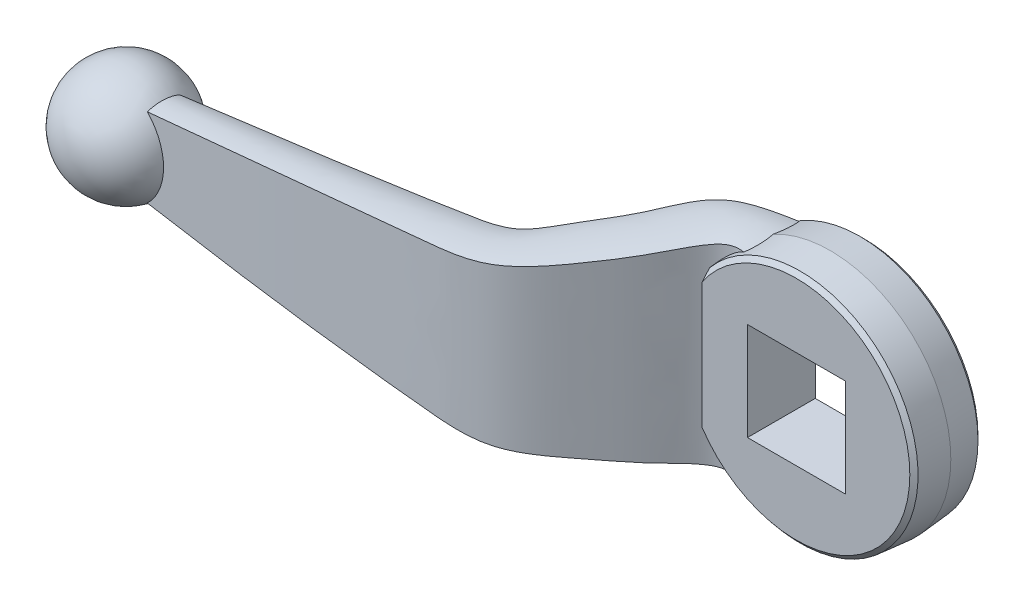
ISO-10303-21;
HEADER;
FILE_DESCRIPTION(('STEP AP214'),'2;1');
FILE_NAME('part.step','',(''),(''),'','','');
FILE_SCHEMA(('AUTOMOTIVE_DESIGN { 1 0 10303 214 1 1 1 1 }'));
ENDSEC;
DATA;
#1=APPLICATION_CONTEXT('core data for automotive mechanical design processes');
#2=APPLICATION_PROTOCOL_DEFINITION('international standard','automotive_design',2000,#1);
#3=PRODUCT_CONTEXT('',#1,'mechanical');
#4=PRODUCT('Part','Part','',(#3));
#5=PRODUCT_RELATED_PRODUCT_CATEGORY('part','',(#4));
#6=PRODUCT_DEFINITION_FORMATION('','',#4);
#7=PRODUCT_DEFINITION_CONTEXT('part definition',#1,'design');
#8=PRODUCT_DEFINITION('design','',#6,#7);
#9=PRODUCT_DEFINITION_SHAPE('','',#8);
#10=(LENGTH_UNIT() NAMED_UNIT(*) SI_UNIT(.MILLI.,.METRE.));
#11=(NAMED_UNIT(*) PLANE_ANGLE_UNIT() SI_UNIT($,.RADIAN.));
#12=(NAMED_UNIT(*) SI_UNIT($,.STERADIAN.) SOLID_ANGLE_UNIT());
#13=UNCERTAINTY_MEASURE_WITH_UNIT(LENGTH_MEASURE(1.E-05),#10,'distance_accuracy_value','');
#14=(GEOMETRIC_REPRESENTATION_CONTEXT(3) GLOBAL_UNCERTAINTY_ASSIGNED_CONTEXT((#13)) GLOBAL_UNIT_ASSIGNED_CONTEXT((#10,
#11,#12)) REPRESENTATION_CONTEXT('',''));
#15=CARTESIAN_POINT('',(0.,0.,0.));
#16=DIRECTION('',(0.,0.,1.));
#17=DIRECTION('',(1.,0.,0.));
#18=AXIS2_PLACEMENT_3D('',#15,#16,#17);
#19=CARTESIAN_POINT('',(0.,0.,0.));
#20=DIRECTION('',(0.,0.,-1.));
#21=DIRECTION('',(1.,0.,0.));
#22=AXIS2_PLACEMENT_3D('',#19,#20,#21);
#23=CONICAL_SURFACE('',#22,16.,0.0872664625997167);
#24=CARTESIAN_POINT('',(-11.998885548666,-10.0471615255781,4.0019026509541));
#25=CARTESIAN_POINT('',(-11.9325658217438,-10.1342780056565,3.94377130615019));
#26=CARTESIAN_POINT('',(-11.8648603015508,-10.2211273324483,3.88675719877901));
#27=CARTESIAN_POINT('',(-11.7260600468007,-10.3947347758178,3.77568415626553));
#28=CARTESIAN_POINT('',(-11.6549524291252,-10.4814910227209,3.7216384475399));
#29=CARTESIAN_POINT('',(-11.5091884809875,-10.654736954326,3.6176592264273));
#30=CARTESIAN_POINT('',(-11.4345280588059,-10.7412262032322,3.5677306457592));
#31=CARTESIAN_POINT('',(-11.3198178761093,-10.8705179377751,3.49704871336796));
#32=CARTESIAN_POINT('',(-11.2812000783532,-10.913464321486,3.47422733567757));
#33=CARTESIAN_POINT('',(-11.2029733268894,-10.9992563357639,3.43014965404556));
#34=CARTESIAN_POINT('',(-11.1633643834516,-11.0421019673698,3.40889333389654));
#35=CARTESIAN_POINT('',(-11.0431515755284,-11.1703179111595,3.34767667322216));
#36=CARTESIAN_POINT('',(-10.9610505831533,-11.2554928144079,3.31019936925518));
#37=CARTESIAN_POINT('',(-10.7930147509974,-11.4248611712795,3.24258731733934));
#38=CARTESIAN_POINT('',(-10.7070825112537,-11.5090552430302,3.21244767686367));
#39=CARTESIAN_POINT('',(-10.5479498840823,-11.6604658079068,3.16493376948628));
#40=CARTESIAN_POINT('',(-10.475368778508,-11.7279165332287,3.14622670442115));
#41=CARTESIAN_POINT('',(-10.3279313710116,-11.8616734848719,3.11421662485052));
#42=CARTESIAN_POINT('',(-10.253074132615,-11.9279792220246,3.10091586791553));
#43=CARTESIAN_POINT('',(-10.1013434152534,-12.0591503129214,3.07983287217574));
#44=CARTESIAN_POINT('',(-10.0244698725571,-12.1240156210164,3.07205080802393));
#45=CARTESIAN_POINT('',(-9.86905156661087,-12.251989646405,3.0619894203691));
#46=CARTESIAN_POINT('',(-9.79050851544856,-12.3151000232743,3.05970471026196));
#47=CARTESIAN_POINT('',(-9.63196156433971,-12.4394101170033,3.06047872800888));
#48=CARTESIAN_POINT('',(-9.55195778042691,-12.5006099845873,3.06353703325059));
#49=CARTESIAN_POINT('',(-9.39078822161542,-12.6209137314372,3.07472602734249));
#50=CARTESIAN_POINT('',(-9.30962272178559,-12.6800180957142,3.08285553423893));
#51=CARTESIAN_POINT('',(-9.05110638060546,-12.8637030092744,3.11609644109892));
#52=CARTESIAN_POINT('',(-8.87194780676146,-12.9842767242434,3.14995630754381));
#53=CARTESIAN_POINT('',(-8.63153939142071,-13.1378307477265,3.20675486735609));
#54=CARTESIAN_POINT('',(-8.57130745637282,-13.1756197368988,3.22192616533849));
#55=CARTESIAN_POINT('',(-8.450593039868,-13.2500370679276,3.25401447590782));
#56=CARTESIAN_POINT('',(-8.39011059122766,-13.2866655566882,3.27093126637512));
#57=CARTESIAN_POINT('',(-8.26895411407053,-13.3587641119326,3.30630748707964));
#58=CARTESIAN_POINT('',(-8.20828021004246,-13.3942348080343,3.32476605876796));
#59=CARTESIAN_POINT('',(-8.14751037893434,-13.4291454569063,3.34390270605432));
#60=B_SPLINE_CURVE_WITH_KNOTS('',3,(#24,#25,#26,#27,#28,#29,#30,#31,#32,#33,#34,#35,#36,#37,#38,
#39,#40,#41,#42,#43,#44,#45,#46,#47,#48,#49,#50,#51,#52,#53,#54,#55,#56,#57,#58,#59),
.UNSPECIFIED.,.F.,.F.,(4,2,2,2,2,2,2,2,2,2,2,2,2,2,2,2,2,4),(0.,0.3719191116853,
0.745379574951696,1.11928108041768,1.30556014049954,1.49183727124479,1.86384820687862,
2.23561041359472,2.53794564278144,2.84040699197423,3.14287791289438,3.44505233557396,
3.74720285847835,4.04928298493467,4.70357339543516,4.92168266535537,5.13976421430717,
5.35772512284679),.UNSPECIFIED.);
#61=CARTESIAN_POINT('',(-11.998885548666,-10.0471615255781,4.0019026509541));
#62=VERTEX_POINT('',#61);
#63=CARTESIAN_POINT('',(-8.14751037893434,-13.4291454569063,3.34390270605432));
#64=VERTEX_POINT('',#63);
#65=EDGE_CURVE('E203',#62,#64,#60,.T.);
#66=ORIENTED_EDGE('',*,*,#65,.T.);
#67=CARTESIAN_POINT('',(-8.14751037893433,-13.4291454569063,3.34390270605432));
#68=CARTESIAN_POINT('',(-8.1252256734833,-13.4452418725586,3.31872838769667));
#69=CARTESIAN_POINT('',(-8.10341483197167,-13.4610292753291,3.29294321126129));
#70=CARTESIAN_POINT('',(-8.06079911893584,-13.4919683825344,3.24018940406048));
#71=CARTESIAN_POINT('',(-8.0399942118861,-13.5071201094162,3.21322081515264));
#72=CARTESIAN_POINT('',(-7.97922973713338,-13.5515557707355,3.13067107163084));
#73=CARTESIAN_POINT('',(-7.94085821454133,-13.5798649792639,3.07337581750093));
#74=CARTESIAN_POINT('',(-7.86916719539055,-13.6334254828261,2.95564543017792));
#75=CARTESIAN_POINT('',(-7.83578471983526,-13.6587139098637,2.89526521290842));
#76=CARTESIAN_POINT('',(-7.77349925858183,-13.7067325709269,2.77124863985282));
#77=CARTESIAN_POINT('',(-7.74459775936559,-13.7294619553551,2.70761121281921));
#78=CARTESIAN_POINT('',(-7.68511357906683,-13.7773790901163,2.56278231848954));
#79=CARTESIAN_POINT('',(-7.65566691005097,-13.8019341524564,2.48091358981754));
#80=CARTESIAN_POINT('',(-7.60325428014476,-13.8475172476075,2.31419994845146));
#81=CARTESIAN_POINT('',(-7.58028981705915,-13.8685444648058,2.22935435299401));
#82=CARTESIAN_POINT('',(-7.52025823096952,-13.9270747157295,1.96990912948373));
#83=CARTESIAN_POINT('',(-7.49264734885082,-13.9595477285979,1.7919033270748));
#84=CARTESIAN_POINT('',(-7.46381082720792,-14.0061682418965,1.47726884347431));
#85=CARTESIAN_POINT('',(-7.45772783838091,-14.022865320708,1.34137127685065));
#86=CARTESIAN_POINT('',(-7.45688357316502,-14.0503200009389,1.06877931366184));
#87=CARTESIAN_POINT('',(-7.46213515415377,-14.0610708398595,0.932084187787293));
#88=CARTESIAN_POINT('',(-7.48262290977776,-14.0769526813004,0.66192356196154));
#89=CARTESIAN_POINT('',(-7.49765789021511,-14.0821914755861,0.528448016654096));
#90=CARTESIAN_POINT('',(-7.53644115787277,-14.0878113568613,0.263011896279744));
#91=CARTESIAN_POINT('',(-7.56016642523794,-14.0882051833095,0.131048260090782));
#92=CARTESIAN_POINT('',(-7.58774280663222,-14.0863820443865,0.));
#93=B_SPLINE_CURVE_WITH_KNOTS('',3,(#67,#68,#69,#70,#71,#72,#73,#74,#75,#76,#77,#78,#79,#80,#81,
#82,#83,#84,#85,#86,#87,#88,#89,#90,#91,#92),.UNSPECIFIED.,.F.,.F.,(4,2,2,2,2,2,2,2,2,2,2,2,4),
(0.,0.111807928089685,0.223611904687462,0.446909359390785,0.667093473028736,0.887350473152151,
1.15814873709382,1.42900952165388,1.9757237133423,2.38633522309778,2.7974127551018,
3.20029286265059,3.6021134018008),.UNSPECIFIED.);
#94=CARTESIAN_POINT('',(-7.58774280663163,-14.0863820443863,0.));
#95=VERTEX_POINT('',#94);
#96=EDGE_CURVE('E218',#64,#95,#93,.T.);
#97=ORIENTED_EDGE('',*,*,#96,.T.);
#98=CARTESIAN_POINT('',(0.,0.,0.));
#99=DIRECTION('',(0.,0.,1.));
#100=DIRECTION('',(1.,0.,0.));
#101=AXIS2_PLACEMENT_3D('',#98,#99,#100);
#102=CIRCLE('',#101,16.);
#103=CARTESIAN_POINT('',(-7.58774280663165,14.0863820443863,0.));
#104=VERTEX_POINT('',#103);
#105=EDGE_CURVE('E284',#95,#104,#102,.T.);
#106=ORIENTED_EDGE('',*,*,#105,.T.);
#107=CARTESIAN_POINT('',(-7.58774280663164,14.0863820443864,0.));
#108=CARTESIAN_POINT('',(-7.56395188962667,14.0879586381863,0.113050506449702));
#109=CARTESIAN_POINT('',(-7.54303141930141,14.0878808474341,0.22676800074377));
#110=CARTESIAN_POINT('',(-7.50754976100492,14.0841712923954,0.455292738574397));
#111=CARTESIAN_POINT('',(-7.49299767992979,14.0805344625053,0.570101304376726));
#112=CARTESIAN_POINT('',(-7.47081047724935,14.0693893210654,0.801619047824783));
#113=CARTESIAN_POINT('',(-7.46326038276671,14.0618351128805,0.918334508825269));
#114=CARTESIAN_POINT('',(-7.45609459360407,14.0425339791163,1.15159089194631));
#115=CARTESIAN_POINT('',(-7.45647456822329,14.0307893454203,1.26813187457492));
#116=CARTESIAN_POINT('',(-7.46885572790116,13.9939762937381,1.57311631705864));
#117=CARTESIAN_POINT('',(-7.48797982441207,13.9651692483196,1.76092144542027));
#118=CARTESIAN_POINT('',(-7.5523631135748,13.8938352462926,2.12882581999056));
#119=CARTESIAN_POINT('',(-7.59752109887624,13.8513616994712,2.30895202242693));
#120=CARTESIAN_POINT('',(-7.70370153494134,13.7616914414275,2.61630926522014));
#121=CARTESIAN_POINT('',(-7.758961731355,13.7176462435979,2.74639452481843));
#122=CARTESIAN_POINT('',(-7.85535594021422,13.6438492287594,2.93113284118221));
#123=CARTESIAN_POINT('',(-7.88971073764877,13.6179817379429,2.99094444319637));
#124=CARTESIAN_POINT('',(-7.96281016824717,13.5636412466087,3.1065480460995));
#125=CARTESIAN_POINT('',(-8.00155205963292,13.535169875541,3.16234252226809));
#126=CARTESIAN_POINT('',(-8.05918670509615,13.4931457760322,3.23799457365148));
#127=CARTESIAN_POINT('',(-8.0763979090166,13.4806344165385,3.25974081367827));
#128=CARTESIAN_POINT('',(-8.11147170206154,13.4551987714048,3.30242656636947));
#129=CARTESIAN_POINT('',(-8.12933390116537,13.4422747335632,3.32336654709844));
#130=CARTESIAN_POINT('',(-8.14751037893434,13.4291454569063,3.34390270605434));
#131=B_SPLINE_CURVE_WITH_KNOTS('',3,(#107,#108,#109,#110,#111,#112,#113,#114,#115,#116,#117,
#118,#119,#120,#121,#122,#123,#124,#125,#126,#127,#128,#129,#130),.UNSPECIFIED.,.F.,.F.,(4,2,2,
2,2,2,2,2,2,2,2,4),(0.,0.346619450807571,0.693732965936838,1.04500840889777,1.39609202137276,
1.96685748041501,2.53541889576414,2.97752586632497,3.19828664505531,3.41891020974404,
3.51016783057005,3.6013716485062),.UNSPECIFIED.);
#132=CARTESIAN_POINT('',(-8.14751037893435,13.4291454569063,3.34390270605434));
#133=VERTEX_POINT('',#132);
#134=EDGE_CURVE('E213',#104,#133,#131,.T.);
#135=ORIENTED_EDGE('',*,*,#134,.T.);
#136=CARTESIAN_POINT('',(-8.14751037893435,13.4291454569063,3.34390270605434));
#137=CARTESIAN_POINT('',(-8.22701988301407,13.3834689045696,3.31886440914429));
#138=CARTESIAN_POINT('',(-8.30636342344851,13.3368356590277,3.29498739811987));
#139=CARTESIAN_POINT('',(-8.46490079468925,13.2414607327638,3.24992024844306));
#140=CARTESIAN_POINT('',(-8.54409337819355,13.1927129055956,3.22873875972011));
#141=CARTESIAN_POINT('',(-8.70212836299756,13.0931260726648,3.18956048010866));
#142=CARTESIAN_POINT('',(-8.78097007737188,13.0422840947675,3.17156842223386));
#143=CARTESIAN_POINT('',(-8.93809324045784,12.9385505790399,3.13922500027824));
#144=CARTESIAN_POINT('',(-9.01637450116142,12.8856583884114,3.12487480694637));
#145=CARTESIAN_POINT('',(-9.17106247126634,12.7786510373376,3.10039482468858));
#146=CARTESIAN_POINT('',(-9.24747988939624,12.7245648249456,3.09020672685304));
#147=CARTESIAN_POINT('',(-9.39934687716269,12.6145572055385,3.07409146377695));
#148=CARTESIAN_POINT('',(-9.47479719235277,12.5586373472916,3.06816079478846));
#149=CARTESIAN_POINT('',(-9.62453167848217,12.4450692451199,3.06081557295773));
#150=CARTESIAN_POINT('',(-9.69881662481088,12.3874222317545,3.05939787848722));
#151=CARTESIAN_POINT('',(-9.84602910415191,12.2705285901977,3.06125471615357));
#152=CARTESIAN_POINT('',(-9.91895694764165,12.2112823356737,3.06452816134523));
#153=CARTESIAN_POINT('',(-10.0805451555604,12.0769821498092,3.07722365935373));
#154=CARTESIAN_POINT('',(-10.1687877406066,12.0015423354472,3.0879311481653));
#155=CARTESIAN_POINT('',(-10.3425070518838,11.8488254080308,3.11669662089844));
#156=CARTESIAN_POINT('',(-10.4279824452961,11.771547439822,3.13475809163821));
#157=CARTESIAN_POINT('',(-10.5957943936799,11.615606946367,3.17799663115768));
#158=CARTESIAN_POINT('',(-10.6781311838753,11.5369445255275,3.20317316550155));
#159=CARTESIAN_POINT('',(-10.839648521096,11.3784239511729,3.26030951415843));
#160=CARTESIAN_POINT('',(-10.9188204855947,11.2985632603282,3.29228645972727));
#161=CARTESIAN_POINT('',(-11.0736560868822,11.1381975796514,3.36245262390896));
#162=CARTESIAN_POINT('',(-11.1493199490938,11.0576926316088,3.40064144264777));
#163=CARTESIAN_POINT('',(-11.2971075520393,10.8963325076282,3.48263024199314));
#164=CARTESIAN_POINT('',(-11.369231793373,10.8154773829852,3.52642942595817));
#165=CARTESIAN_POINT('',(-11.4728488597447,10.6964096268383,3.59402661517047));
#166=CARTESIAN_POINT('',(-11.5056121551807,10.6583140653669,3.61611874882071));
#167=CARTESIAN_POINT('',(-11.5704444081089,10.5820599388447,3.66116095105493));
#168=CARTESIAN_POINT('',(-11.6025135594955,10.5439013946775,3.68411077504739));
#169=CARTESIAN_POINT('',(-11.6659931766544,10.4675111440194,3.73077362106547));
#170=CARTESIAN_POINT('',(-11.6974036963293,10.4292794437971,3.75448658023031));
#171=CARTESIAN_POINT('',(-11.7594325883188,10.3529368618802,3.80246265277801));
#172=CARTESIAN_POINT('',(-11.7900542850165,10.3148264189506,3.8267221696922));
#173=CARTESIAN_POINT('',(-11.850706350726,10.2385145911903,3.87583520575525));
#174=CARTESIAN_POINT('',(-11.8807366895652,10.2003132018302,3.90068875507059));
#175=CARTESIAN_POINT('',(-11.9402301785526,10.1238127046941,3.95091991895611));
#176=CARTESIAN_POINT('',(-11.9696933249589,10.0855135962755,3.97629753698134));
#177=CARTESIAN_POINT('',(-11.998885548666,10.0471615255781,4.00190265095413));
#178=B_SPLINE_CURVE_WITH_KNOTS('',3,(#136,#137,#138,#139,#140,#141,#142,#143,#144,#145,#146,
#147,#148,#149,#150,#151,#152,#153,#154,#155,#156,#157,#158,#159,#160,#161,#162,#163,#164,#165,
#166,#167,#168,#169,#170,#171,#172,#173,#174,#175,#176,#177),.UNSPECIFIED.,.F.,.F.,(4,2,2,2,2,2,
2,2,2,2,2,2,2,2,2,2,2,2,2,2,4),(0.,0.285168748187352,0.571230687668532,0.857713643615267,
1.14428857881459,1.42669837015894,1.70887547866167,1.99085611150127,2.2727714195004,
2.62224299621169,2.97188046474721,3.3214916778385,3.6719942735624,4.02247431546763,
4.37290464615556,4.53756307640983,4.70217490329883,4.86677320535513,5.03049614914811,
5.19422742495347,5.35795978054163),.UNSPECIFIED.);
#179=CARTESIAN_POINT('',(-11.998885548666,10.0471615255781,4.00190265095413));
#180=VERTEX_POINT('',#179);
#181=EDGE_CURVE('E208',#133,#180,#178,.T.);
#182=ORIENTED_EDGE('',*,*,#181,.T.);
#183=CARTESIAN_POINT('',(0.,0.,4.00190265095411));
#184=DIRECTION('',(0.,0.,-1.));
#185=DIRECTION('',(-1.,0.,0.));
#186=AXIS2_PLACEMENT_3D('',#183,#184,#185);
#187=CIRCLE('',#186,15.6498788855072);
#188=EDGE_CURVE('E276',#180,#62,#187,.T.);
#189=ORIENTED_EDGE('',*,*,#188,.T.);
#190=EDGE_LOOP('',(#66,#97,#106,#135,#182,#189));
#191=FACE_BOUND('',#190,.T.);
#192=ADVANCED_FACE('F30',(#191),#23,.T.);
#193=CARTESIAN_POINT('',(0.,0.,4.49999999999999));
#194=DIRECTION('',(0.,0.,1.));
#195=DIRECTION('',(1.,0.,0.));
#196=AXIS2_PLACEMENT_3D('',#193,#194,#195);
#197=PLANE('',#196);
#198=CARTESIAN_POINT('',(-12.5146904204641,-12.5984396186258,4.49999999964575));
#199=CARTESIAN_POINT('',(-12.5146904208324,-10.554742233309,4.49999999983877));
#200=CARTESIAN_POINT('',(-12.5146904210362,-8.51104484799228,4.4999999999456));
#201=CARTESIAN_POINT('',(-12.5146904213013,-3.28971628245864,4.50000000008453));
#202=CARTESIAN_POINT('',(-12.5146904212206,-0.112085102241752,4.50000000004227));
#203=CARTESIAN_POINT('',(-12.5146904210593,6.2431772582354,4.49999999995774));
#204=CARTESIAN_POINT('',(-12.5146904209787,9.42080843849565,4.49999999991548));
#205=CARTESIAN_POINT('',(-12.51469042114,12.5984396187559,4.50000000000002));
#206=B_SPLINE_CURVE_WITH_KNOTS('',3,(#198,#199,#200,#201,#202,#203,#204,#205),.UNSPECIFIED.,.F.,
.F.,(4,2,2,4),(0.,6.13109215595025,15.6639856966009,25.1968792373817),.UNSPECIFIED.);
#207=CARTESIAN_POINT('',(-12.5146904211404,-8.37100814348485,4.50000000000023));
#208=VERTEX_POINT('',#207);
#209=CARTESIAN_POINT('',(-12.51469042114,8.37100814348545,4.5));
#210=VERTEX_POINT('',#209);
#211=EDGE_CURVE('E128',#208,#210,#206,.T.);
#212=ORIENTED_EDGE('',*,*,#211,.F.);
#213=CARTESIAN_POINT('',(0.,0.,4.49999999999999));
#214=DIRECTION('',(0.,0.,1.));
#215=DIRECTION('',(1.,0.,0.));
#216=AXIS2_PLACEMENT_3D('',#213,#214,#215);
#217=CIRCLE('',#216,15.0562695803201);
#218=EDGE_CURVE('E281',#208,#210,#217,.T.);
#219=ORIENTED_EDGE('',*,*,#218,.T.);
#220=EDGE_LOOP('',(#212,#219));
#221=FACE_BOUND('',#220,.T.);
#222=DIRECTION('',(0.,1.,0.));
#223=VECTOR('',#222,1.);
#224=CARTESIAN_POINT('',(6.50000000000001,-6.50000000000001,4.49999999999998));
#225=LINE('',#224,#223);
#226=CARTESIAN_POINT('',(6.50000000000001,-6.50000000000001,4.49999999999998));
#227=VERTEX_POINT('',#226);
#228=CARTESIAN_POINT('',(6.5,6.5,4.5));
#229=VERTEX_POINT('',#228);
#230=EDGE_CURVE('E223',#227,#229,#225,.T.);
#231=ORIENTED_EDGE('',*,*,#230,.F.);
#232=DIRECTION('',(-1.,0.,0.));
#233=VECTOR('',#232,1.);
#234=CARTESIAN_POINT('',(6.50000000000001,-6.50000000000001,4.49999999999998));
#235=LINE('',#234,#233);
#236=CARTESIAN_POINT('',(-6.5,-6.5,4.49999999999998));
#237=VERTEX_POINT('',#236);
#238=EDGE_CURVE('E307',#227,#237,#235,.T.);
#239=ORIENTED_EDGE('',*,*,#238,.T.);
#240=DIRECTION('',(0.,1.,0.));
#241=VECTOR('',#240,1.);
#242=CARTESIAN_POINT('',(-6.5,-6.5,4.49999999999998));
#243=LINE('',#242,#241);
#244=CARTESIAN_POINT('',(-6.50000000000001,6.5,4.49999999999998));
#245=VERTEX_POINT('',#244);
#246=EDGE_CURVE('E310',#237,#245,#243,.T.);
#247=ORIENTED_EDGE('',*,*,#246,.T.);
#248=DIRECTION('',(1.,0.,0.));
#249=VECTOR('',#248,1.);
#250=CARTESIAN_POINT('',(-6.50000000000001,6.5,4.49999999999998));
#251=LINE('',#250,#249);
#252=EDGE_CURVE('E312',#245,#229,#251,.T.);
#253=ORIENTED_EDGE('',*,*,#252,.T.);
#254=EDGE_LOOP('',(#231,#239,#247,#253));
#255=FACE_BOUND('',#254,.T.);
#256=ADVANCED_FACE('F253',(#221,#255),#197,.T.);
#257=CARTESIAN_POINT('',(0.,0.,0.));
#258=DIRECTION('',(0.,0.,1.));
#259=DIRECTION('',(1.,0.,0.));
#260=AXIS2_PLACEMENT_3D('',#257,#258,#259);
#261=CONICAL_SURFACE('',#260,16.,0.0872664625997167);
#262=CARTESIAN_POINT('',(-7.83681698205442,-13.5771691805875,-3.69668459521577));
#263=CARTESIAN_POINT('',(-7.79930850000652,-13.6091041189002,-3.59487218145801));
#264=CARTESIAN_POINT('',(-7.7637117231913,-13.6397889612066,-3.49194145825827));
#265=CARTESIAN_POINT('',(-7.69674583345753,-13.6985825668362,-3.28377647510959));
#266=CARTESIAN_POINT('',(-7.66538436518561,-13.7266866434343,-3.1785384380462));
#267=CARTESIAN_POINT('',(-7.60741582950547,-13.7801414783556,-2.96600240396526));
#268=CARTESIAN_POINT('',(-7.58081114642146,-13.8054908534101,-2.85870340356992));
#269=CARTESIAN_POINT('',(-7.53358407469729,-13.8525388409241,-2.64564533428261));
#270=CARTESIAN_POINT('',(-7.51280200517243,-13.8743261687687,-2.5399414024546));
#271=CARTESIAN_POINT('',(-7.47656852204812,-13.9150246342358,-2.32713031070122));
#272=CARTESIAN_POINT('',(-7.46111425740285,-13.9339373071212,-2.22002393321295));
#273=CARTESIAN_POINT('',(-7.43588283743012,-13.9687648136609,-2.00468530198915));
#274=CARTESIAN_POINT('',(-7.42610408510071,-13.9846804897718,-1.8964533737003));
#275=CARTESIAN_POINT('',(-7.41317898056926,-14.0119846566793,-1.68988057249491));
#276=CARTESIAN_POINT('',(-7.40947528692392,-14.0236643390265,-1.59161292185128));
#277=CARTESIAN_POINT('',(-7.40707656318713,-14.0444088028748,-1.39472465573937));
#278=CARTESIAN_POINT('',(-7.40838216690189,-14.0534732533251,-1.29610399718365));
#279=CARTESIAN_POINT('',(-7.41610423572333,-14.0689109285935,-1.09885169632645));
#280=CARTESIAN_POINT('',(-7.42252066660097,-14.0752841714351,-1.00022005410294));
#281=CARTESIAN_POINT('',(-7.44075721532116,-14.0854168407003,-0.800496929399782));
#282=CARTESIAN_POINT('',(-7.45272516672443,-14.0890971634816,-0.699414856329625));
#283=CARTESIAN_POINT('',(-7.48208834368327,-14.0934840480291,-0.49796092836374));
#284=CARTESIAN_POINT('',(-7.49948441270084,-14.0941901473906,-0.397589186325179));
#285=CARTESIAN_POINT('',(-7.53962387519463,-14.0925732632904,-0.197899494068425));
#286=CARTESIAN_POINT('',(-7.56236962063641,-14.0902489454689,-0.0985820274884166));
#287=CARTESIAN_POINT('',(-7.58774280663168,-14.0863820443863,0.));
#288=B_SPLINE_CURVE_WITH_KNOTS('',3,(#262,#263,#264,#265,#266,#267,#268,#269,#270,#271,#272,
#273,#274,#275,#276,#277,#278,#279,#280,#281,#282,#283,#284,#285,#286,#287),.UNSPECIFIED.,.F.,
.F.,(4,2,2,2,2,2,2,2,2,2,2,2,4),(0.,0.339312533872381,0.679229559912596,1.01931649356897,
1.34887667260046,1.67826022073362,2.00755104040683,2.30448183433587,2.60145019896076,
2.89841657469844,3.20378993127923,3.50921076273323,3.81476612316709),.UNSPECIFIED.);
#289=CARTESIAN_POINT('',(-7.83681698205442,-13.5771691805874,-3.69668459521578));
#290=VERTEX_POINT('',#289);
#291=EDGE_CURVE('E43',#290,#95,#288,.T.);
#292=ORIENTED_EDGE('',*,*,#291,.F.);
#293=CARTESIAN_POINT('',(-7.83681698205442,13.5771691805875,-3.69668459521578));
#294=CARTESIAN_POINT('',(-8.09470798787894,13.4304535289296,-3.67562879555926));
#295=CARTESIAN_POINT('',(-8.34841514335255,13.2764255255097,-3.6543302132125));
#296=CARTESIAN_POINT('',(-8.84665750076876,12.9543774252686,-3.61061844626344));
#297=CARTESIAN_POINT('',(-9.09119349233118,12.7863585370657,-3.58820535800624));
#298=CARTESIAN_POINT('',(-9.57032709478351,12.4369408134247,-3.54163280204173));
#299=CARTESIAN_POINT('',(-9.80492499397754,12.2555423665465,-3.51747338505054));
#300=CARTESIAN_POINT('',(-10.2628881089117,11.8804920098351,-3.46702476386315));
#301=CARTESIAN_POINT('',(-10.4862798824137,11.6868717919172,-3.44074102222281));
#302=CARTESIAN_POINT('',(-10.9217698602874,11.2876590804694,-3.38568390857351));
#303=CARTESIAN_POINT('',(-11.1338681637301,11.0820666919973,-3.35691055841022));
#304=CARTESIAN_POINT('',(-11.5461328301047,10.6596194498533,-3.29671916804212));
#305=CARTESIAN_POINT('',(-11.7462993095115,10.4427647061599,-3.26530115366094));
#306=CARTESIAN_POINT('',(-12.1343829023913,9.99820397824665,-3.19977639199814));
#307=CARTESIAN_POINT('',(-12.3222824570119,9.77048321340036,-3.16566593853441));
#308=CARTESIAN_POINT('',(-12.6849821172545,9.30520117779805,-3.0949659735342));
#309=CARTESIAN_POINT('',(-12.8597819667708,9.06763971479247,-3.05837641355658));
#310=CARTESIAN_POINT('',(-13.1957769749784,8.58340812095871,-2.98307282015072));
#311=CARTESIAN_POINT('',(-13.3569721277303,8.33673798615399,-2.94435878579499));
#312=CARTESIAN_POINT('',(-13.6655334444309,7.83461595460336,-2.86529605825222));
#313=CARTESIAN_POINT('',(-13.8128778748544,7.5791510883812,-2.82494493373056));
#314=CARTESIAN_POINT('',(-14.0930247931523,7.06049012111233,-2.74342569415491));
#315=CARTESIAN_POINT('',(-14.2258272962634,6.79729402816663,-2.70225757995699));
#316=CARTESIAN_POINT('',(-14.4764742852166,6.26384685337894,-2.62009421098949));
#317=CARTESIAN_POINT('',(-14.5943179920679,5.99359540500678,-2.57909896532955));
#318=CARTESIAN_POINT('',(-14.8723187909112,5.30349805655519,-2.47735847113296));
#319=CARTESIAN_POINT('',(-15.0223403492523,4.8793880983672,-2.41750643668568));
#320=CARTESIAN_POINT('',(-15.28520379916,4.01863187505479,-2.30610449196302));
#321=CARTESIAN_POINT('',(-15.3980448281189,3.58198531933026,-2.25455477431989));
#322=CARTESIAN_POINT('',(-15.5381109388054,2.92049810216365,-2.18782067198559));
#323=CARTESIAN_POINT('',(-15.5799002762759,2.69919172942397,-2.1673596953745));
#324=CARTESIAN_POINT('',(-15.6536674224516,2.25461710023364,-2.1305934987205));
#325=CARTESIAN_POINT('',(-15.6856465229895,2.03134910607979,-2.11428773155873));
#326=CARTESIAN_POINT('',(-15.7396330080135,1.58333992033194,-2.08641654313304));
#327=CARTESIAN_POINT('',(-15.7616414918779,1.35859889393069,-2.07485059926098));
#328=CARTESIAN_POINT('',(-15.7955701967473,0.908175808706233,-2.05689747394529));
#329=CARTESIAN_POINT('',(-15.8074915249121,0.682493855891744,-2.05050972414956));
#330=CARTESIAN_POINT('',(-15.8226440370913,0.182284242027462,-2.0423862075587));
#331=CARTESIAN_POINT('',(-15.8234641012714,-0.092342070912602,-2.04194143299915));
#332=CARTESIAN_POINT('',(-15.8101133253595,-0.64113088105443,-2.04910710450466));
#333=CARTESIAN_POINT('',(-15.7959416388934,-0.915293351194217,-2.05671800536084));
#334=CARTESIAN_POINT('',(-15.7527325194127,-1.46211009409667,-2.07954395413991));
#335=CARTESIAN_POINT('',(-15.7236956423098,-1.73476442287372,-2.09475871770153));
#336=CARTESIAN_POINT('',(-15.6509274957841,-2.27810502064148,-2.13197598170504));
#337=CARTESIAN_POINT('',(-15.6071710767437,-2.54878710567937,-2.15399009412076));
#338=CARTESIAN_POINT('',(-15.5052793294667,-3.08690558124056,-2.20367201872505));
#339=CARTESIAN_POINT('',(-15.4471436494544,-3.35434189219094,-2.23133996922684));
#340=CARTESIAN_POINT('',(-15.3168378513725,-3.88525509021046,-2.29107173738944));
#341=CARTESIAN_POINT('',(-15.2446676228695,-4.14873194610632,-2.32313558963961));
#342=CARTESIAN_POINT('',(-15.0528008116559,-4.78296513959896,-2.40478256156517));
#343=CARTESIAN_POINT('',(-14.9259826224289,-5.15137864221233,-2.45599087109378));
#344=CARTESIAN_POINT('',(-14.6454174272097,-5.87728783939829,-2.56135586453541));
#345=CARTESIAN_POINT('',(-14.491672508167,-6.23478437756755,-2.61551231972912));
#346=CARTESIAN_POINT('',(-14.1582156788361,-6.9373452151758,-2.72395288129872));
#347=CARTESIAN_POINT('',(-13.9785093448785,-7.2824121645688,-2.77823695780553));
#348=CARTESIAN_POINT('',(-13.5940641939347,-7.95864222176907,-2.88480428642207));
#349=CARTESIAN_POINT('',(-13.3893238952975,-8.2898045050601,-2.93708741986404));
#350=CARTESIAN_POINT('',(-12.9244081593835,-8.98348597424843,-3.04548503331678));
#351=CARTESIAN_POINT('',(-12.6604988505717,-9.34359650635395,-3.10105708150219));
#352=CARTESIAN_POINT('',(-12.1028924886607,-10.0409841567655,-3.2063665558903));
#353=CARTESIAN_POINT('',(-11.8091896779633,-10.3782568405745,-3.25610285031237));
#354=CARTESIAN_POINT('',(-11.1942602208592,-11.0271001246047,-3.3493888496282));
#355=CARTESIAN_POINT('',(-10.8730561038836,-11.3386913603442,-3.39294354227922));
#356=CARTESIAN_POINT('',(-10.20526375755,-11.9338905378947,-3.47443652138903));
#357=CARTESIAN_POINT('',(-9.85868752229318,-12.2175115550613,-3.51237743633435));
#358=CARTESIAN_POINT('',(-9.23500229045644,-12.6852218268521,-3.57473029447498));
#359=CARTESIAN_POINT('',(-8.96305345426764,-12.8761056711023,-3.60010648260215));
#360=CARTESIAN_POINT('',(-8.40807906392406,-13.2400673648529,-3.64931929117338));
#361=CARTESIAN_POINT('',(-8.12507485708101,-13.41317739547,-3.67315866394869));
#362=CARTESIAN_POINT('',(-7.83681698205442,-13.5771691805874,-3.69668459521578));
#363=B_SPLINE_CURVE_WITH_KNOTS('',3,(#293,#294,#295,#296,#297,#298,#299,#300,#301,#302,#303,
#304,#305,#306,#307,#308,#309,#310,#311,#312,#313,#314,#315,#316,#317,#318,#319,#320,#321,#322,
#323,#324,#325,#326,#327,#328,#329,#330,#331,#332,#333,#334,#335,#336,#337,#338,#339,#340,#341,
#342,#343,#344,#345,#346,#347,#348,#349,#350,#351,#352,#353,#354,#355,#356,#357,#358,#359,#360,
#361,#362),.UNSPECIFIED.,.F.,.F.,(4,2,2,2,2,2,2,2,2,2,2,2,2,2,2,2,2,2,2,2,2,2,2,2,2,2,2,2,2,2,2,
2,2,2,4),(0.,0.892227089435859,1.78437718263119,2.67650137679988,3.56640037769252,
4.4562915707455,5.34617407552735,6.2373036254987,7.12845059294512,8.01959794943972,
8.91212106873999,9.80464325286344,10.6972118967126,12.056943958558,13.4167075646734,
14.0949265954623,14.7730562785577,15.4511111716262,16.1290916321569,16.9524291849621,
17.7758132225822,18.5991664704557,19.423933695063,20.2487210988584,21.0735149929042,
22.2512767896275,23.4289473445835,24.6063653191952,25.7838530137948,27.1319437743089,
28.4802955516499,29.8275531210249,31.1741778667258,32.1732108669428,33.1704018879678),.UNSPECIFIED.);
#364=CARTESIAN_POINT('',(-7.83681698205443,13.5771691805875,-3.69668459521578));
#365=VERTEX_POINT('',#364);
#366=EDGE_CURVE('E124',#365,#290,#363,.T.);
#367=ORIENTED_EDGE('',*,*,#366,.F.);
#368=CARTESIAN_POINT('',(-7.58774280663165,14.0863820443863,0.));
#369=CARTESIAN_POINT('',(-7.55094015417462,14.0919891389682,-0.14287727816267));
#370=CARTESIAN_POINT('',(-7.51969957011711,14.0943518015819,-0.28730504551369));
#371=CARTESIAN_POINT('',(-7.46852965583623,14.0927611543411,-0.578053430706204));
#372=CARTESIAN_POINT('',(-7.44859544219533,14.0888105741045,-0.724373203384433));
#373=CARTESIAN_POINT('',(-7.42029397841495,14.0748206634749,-1.01678243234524));
#374=CARTESIAN_POINT('',(-7.41184570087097,14.0648247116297,-1.16286616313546));
#375=CARTESIAN_POINT('',(-7.40608846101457,14.038994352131,-1.45472773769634));
#376=CARTESIAN_POINT('',(-7.40877957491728,14.0231599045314,-1.60050557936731));
#377=CARTESIAN_POINT('',(-7.42483995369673,13.9859501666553,-1.89044045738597));
#378=CARTESIAN_POINT('',(-7.43818737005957,13.9645862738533,-2.03460019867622));
#379=CARTESIAN_POINT('',(-7.47483651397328,13.9165859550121,-2.32081271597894));
#380=CARTESIAN_POINT('',(-7.49814287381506,13.8899470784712,-2.46286447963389));
#381=CARTESIAN_POINT('',(-7.55382263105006,13.8317119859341,-2.74414638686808));
#382=CARTESIAN_POINT('',(-7.58619742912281,13.800115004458,-2.88337609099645));
#383=CARTESIAN_POINT('',(-7.65902709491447,13.7322692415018,-3.15854318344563));
#384=CARTESIAN_POINT('',(-7.69948195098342,13.6960204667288,-3.29448057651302));
#385=CARTESIAN_POINT('',(-7.75825994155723,13.6446676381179,-3.47372886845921));
#386=CARTESIAN_POINT('',(-7.77345645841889,13.6314932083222,-3.51864929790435));
#387=CARTESIAN_POINT('',(-7.80458765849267,13.6046808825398,-3.60800919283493));
#388=CARTESIAN_POINT('',(-7.82052114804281,13.5910437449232,-3.65244930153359));
#389=CARTESIAN_POINT('',(-7.83681698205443,13.5771691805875,-3.69668459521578));
#390=B_SPLINE_CURVE_WITH_KNOTS('',3,(#368,#369,#370,#371,#372,#373,#374,#375,#376,#377,#378,
#379,#380,#381,#382,#383,#384,#385,#386,#387,#388,#389),.UNSPECIFIED.,.F.,.F.,(4,2,2,2,2,2,2,2,
2,2,4),(0.,0.442783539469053,0.885375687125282,1.3248290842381,1.76428548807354,
2.20284318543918,2.6416050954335,3.08043481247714,3.51926389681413,3.66690926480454,
3.81432334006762),.UNSPECIFIED.);
#391=EDGE_CURVE('E259',#104,#365,#390,.T.);
#392=ORIENTED_EDGE('',*,*,#391,.F.);
#393=ORIENTED_EDGE('',*,*,#105,.F.);
#394=EDGE_LOOP('',(#292,#367,#392,#393));
#395=FACE_BOUND('',#394,.T.);
#396=CARTESIAN_POINT('',(0.,0.,-3.95206160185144));
#397=DIRECTION('',(0.,0.,1.));
#398=DIRECTION('',(1.,0.,0.));
#399=AXIS2_PLACEMENT_3D('',#396,#397,#398);
#400=CIRCLE('',#399,15.6542394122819);
#401=CARTESIAN_POINT('',(15.6542394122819,0.,-3.95206160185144));
#402=VERTEX_POINT('',#401);
#403=EDGE_CURVE('E272',#402,#402,#400,.T.);
#404=ORIENTED_EDGE('',*,*,#403,.T.);
#405=EDGE_LOOP('',(#404));
#406=FACE_BOUND('',#405,.T.);
#407=ADVANCED_FACE('F248',(#395,#406),#261,.T.);
#408=CARTESIAN_POINT('',(0.,0.,-4.5));
#409=DIRECTION('',(0.,0.,1.));
#410=DIRECTION('',(1.,0.,0.));
#411=AXIS2_PLACEMENT_3D('',#408,#409,#410);
#412=PLANE('',#411);
#413=DIRECTION('',(-1.,0.,0.));
#414=VECTOR('',#413,1.);
#415=CARTESIAN_POINT('',(6.50000000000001,-6.50000000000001,-4.49999999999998));
#416=LINE('',#415,#414);
#417=CARTESIAN_POINT('',(6.50000000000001,-6.50000000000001,-4.49999999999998));
#418=VERTEX_POINT('',#417);
#419=CARTESIAN_POINT('',(-6.50000000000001,-6.5,-4.50000000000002));
#420=VERTEX_POINT('',#419);
#421=EDGE_CURVE('E296',#418,#420,#416,.T.);
#422=ORIENTED_EDGE('',*,*,#421,.F.);
#423=DIRECTION('',(0.,1.,0.));
#424=VECTOR('',#423,1.);
#425=CARTESIAN_POINT('',(6.50000000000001,-6.50000000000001,-4.49999999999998));
#426=LINE('',#425,#424);
#427=CARTESIAN_POINT('',(6.50000000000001,6.5,-4.49999999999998));
#428=VERTEX_POINT('',#427);
#429=EDGE_CURVE('E304',#418,#428,#426,.T.);
#430=ORIENTED_EDGE('',*,*,#429,.T.);
#431=DIRECTION('',(1.,0.,0.));
#432=VECTOR('',#431,1.);
#433=CARTESIAN_POINT('',(-6.50000000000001,6.5,-4.50000000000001));
#434=LINE('',#433,#432);
#435=CARTESIAN_POINT('',(-6.50000000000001,6.5,-4.50000000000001));
#436=VERTEX_POINT('',#435);
#437=EDGE_CURVE('E301',#436,#428,#434,.T.);
#438=ORIENTED_EDGE('',*,*,#437,.F.);
#439=DIRECTION('',(0.,1.,0.));
#440=VECTOR('',#439,1.);
#441=CARTESIAN_POINT('',(-6.50000000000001,-6.5,-4.50000000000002));
#442=LINE('',#441,#440);
#443=EDGE_CURVE('E299',#420,#436,#442,.T.);
#444=ORIENTED_EDGE('',*,*,#443,.F.);
#445=EDGE_LOOP('',(#422,#430,#438,#444));
#446=FACE_BOUND('',#445,.T.);
#447=CARTESIAN_POINT('',(0.,0.,-4.5));
#448=DIRECTION('',(0.,0.,1.));
#449=DIRECTION('',(1.,0.,0.));
#450=AXIS2_PLACEMENT_3D('',#447,#448,#449);
#451=CIRCLE('',#450,15.1063010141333);
#452=CARTESIAN_POINT('',(15.1063010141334,0.,-4.5));
#453=VERTEX_POINT('',#452);
#454=EDGE_CURVE('E269',#453,#453,#451,.F.);
#455=ORIENTED_EDGE('',*,*,#454,.T.);
#456=EDGE_LOOP('',(#455));
#457=FACE_BOUND('',#456,.T.);
#458=ADVANCED_FACE('F252',(#446,#457),#412,.F.);
#459=CARTESIAN_POINT('',(0.,0.,4.49999999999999));
#460=DIRECTION('',(0.,0.,-1.));
#461=DIRECTION('',(-1.,0.,0.));
#462=AXIS2_PLACEMENT_3D('',#459,#460,#461);
#463=CONICAL_SURFACE('',#462,15.0562695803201,0.87266462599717);
#464=CARTESIAN_POINT('',(-12.51469042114,8.37100814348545,4.5));
#465=CARTESIAN_POINT('',(-12.4894337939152,8.46550914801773,4.47352805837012));
#466=CARTESIAN_POINT('',(-12.4636630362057,8.55980038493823,4.44679652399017));
#467=CARTESIAN_POINT('',(-12.4110536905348,8.74791714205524,4.39287823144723));
#468=CARTESIAN_POINT('',(-12.3842154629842,8.84174280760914,4.36569162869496));
#469=CARTESIAN_POINT('',(-12.3294196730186,9.02892875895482,4.31091427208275));
#470=CARTESIAN_POINT('',(-12.3014623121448,9.12228912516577,4.28332359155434));
#471=CARTESIAN_POINT('',(-12.2443628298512,9.3085451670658,4.22779486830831));
#472=CARTESIAN_POINT('',(-12.2152206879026,9.40144083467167,4.19985681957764));
#473=CARTESIAN_POINT('',(-12.1556770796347,9.58676009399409,4.1436972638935));
#474=CARTESIAN_POINT('',(-12.1252754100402,9.67918360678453,4.11547571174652));
#475=CARTESIAN_POINT('',(-12.0631170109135,9.86354905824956,4.05882353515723));
#476=CARTESIAN_POINT('',(-12.0313598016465,9.95549081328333,4.03039283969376));
#477=CARTESIAN_POINT('',(-11.998885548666,10.0471615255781,4.00190265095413));
#478=B_SPLINE_CURVE_WITH_KNOTS('',3,(#464,#465,#466,#467,#468,#469,#470,#471,#472,#473,#474,
#475,#476,#477),.UNSPECIFIED.,.F.,.F.,(4,2,2,2,2,2,4),(0.,0.304008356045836,0.607914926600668,
0.911767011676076,1.21562436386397,1.51953094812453,1.82354599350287),.UNSPECIFIED.);
#479=EDGE_CURVE('E191',#210,#180,#478,.T.);
#480=ORIENTED_EDGE('',*,*,#479,.F.);
#481=ORIENTED_EDGE('',*,*,#218,.F.);
#482=CARTESIAN_POINT('',(-11.998885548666,-10.0471615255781,4.0019026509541));
#483=CARTESIAN_POINT('',(-12.0313598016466,-9.9554908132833,4.03039283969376));
#484=CARTESIAN_POINT('',(-12.0631170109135,-9.8635490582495,4.05882353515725));
#485=CARTESIAN_POINT('',(-12.1252754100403,-9.67918360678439,4.11547571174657));
#486=CARTESIAN_POINT('',(-12.1556770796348,-9.58676009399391,4.14369726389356));
#487=CARTESIAN_POINT('',(-12.2152206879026,-9.40144083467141,4.19985681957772));
#488=CARTESIAN_POINT('',(-12.2443628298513,-9.3085451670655,4.22779486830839));
#489=CARTESIAN_POINT('',(-12.3014623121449,-9.12228912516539,4.28332359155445));
#490=CARTESIAN_POINT('',(-12.3294196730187,-9.02892875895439,4.31091427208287));
#491=CARTESIAN_POINT('',(-12.3842154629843,-8.84174280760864,4.36569162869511));
#492=CARTESIAN_POINT('',(-12.4110536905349,-8.7479171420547,4.39287823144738));
#493=CARTESIAN_POINT('',(-12.4636630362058,-8.55980038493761,4.44679652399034));
#494=CARTESIAN_POINT('',(-12.4894337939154,-8.46550914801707,4.4735280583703));
#495=CARTESIAN_POINT('',(-12.5146904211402,-8.37100814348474,4.50000000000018));
#496=B_SPLINE_CURVE_WITH_KNOTS('',3,(#482,#483,#484,#485,#486,#487,#488,#489,#490,#491,#492,
#493,#494,#495),.UNSPECIFIED.,.F.,.F.,(4,2,2,2,2,2,4),(0.,0.30401504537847,0.607921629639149,
0.911778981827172,1.21563106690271,1.51953763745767,1.82354599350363),.UNSPECIFIED.);
#497=EDGE_CURVE('E182',#62,#208,#496,.T.);
#498=ORIENTED_EDGE('',*,*,#497,.F.);
#499=ORIENTED_EDGE('',*,*,#188,.F.);
#500=EDGE_LOOP('',(#480,#481,#498,#499));
#501=FACE_BOUND('',#500,.T.);
#502=ADVANCED_FACE('F255',(#501),#463,.T.);
#503=CARTESIAN_POINT('',(0.,0.,-3.95206160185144));
#504=DIRECTION('',(0.,0.,1.));
#505=DIRECTION('',(1.,0.,0.));
#506=AXIS2_PLACEMENT_3D('',#503,#504,#505);
#507=CONICAL_SURFACE('',#506,15.6542394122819,0.78539816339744);
#508=CARTESIAN_POINT('',(15.1063010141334,0.,-4.5));
#509=CARTESIAN_POINT('',(15.1120087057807,0.,-4.49429230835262));
#510=CARTESIAN_POINT('',(15.1177163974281,0.,-4.48858461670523));
#511=CARTESIAN_POINT('',(15.1291317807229,0.,-4.47716923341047));
#512=CARTESIAN_POINT('',(15.1348394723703,0.,-4.47146154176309));
#513=CARTESIAN_POINT('',(15.146254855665,0.,-4.46004615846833));
#514=CARTESIAN_POINT('',(15.1519625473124,0.,-4.45433846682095));
#515=CARTESIAN_POINT('',(15.1633779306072,0.,-4.44292308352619));
#516=CARTESIAN_POINT('',(15.1690856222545,0.,-4.43721539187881));
#517=CARTESIAN_POINT('',(15.1805010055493,0.,-4.42580000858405));
#518=CARTESIAN_POINT('',(15.1862086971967,0.,-4.42009231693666));
#519=CARTESIAN_POINT('',(15.1976240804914,0.,-4.4086769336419));
#520=CARTESIAN_POINT('',(15.2033317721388,0.,-4.40296924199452));
#521=CARTESIAN_POINT('',(15.2147471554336,0.,-4.39155385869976));
#522=CARTESIAN_POINT('',(15.220454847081,0.,-4.38584616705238));
#523=CARTESIAN_POINT('',(15.2318702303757,0.,-4.37443078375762));
#524=CARTESIAN_POINT('',(15.2375779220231,0.,-4.36872309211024));
#525=CARTESIAN_POINT('',(15.2489933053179,0.,-4.35730770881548));
#526=CARTESIAN_POINT('',(15.2547009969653,0.,-4.35160001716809));
#527=CARTESIAN_POINT('',(15.26611638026,0.,-4.34018463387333));
#528=CARTESIAN_POINT('',(15.2718240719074,0.,-4.33447694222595));
#529=CARTESIAN_POINT('',(15.2832394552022,0.,-4.32306155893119));
#530=CARTESIAN_POINT('',(15.2889471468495,0.,-4.31735386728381));
#531=CARTESIAN_POINT('',(15.3003625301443,0.,-4.30593848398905));
#532=CARTESIAN_POINT('',(15.3060702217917,0.,-4.30023079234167));
#533=CARTESIAN_POINT('',(15.3174856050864,0.,-4.28881540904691));
#534=CARTESIAN_POINT('',(15.3231932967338,0.,-4.28310771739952));
#535=CARTESIAN_POINT('',(15.3346086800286,0.,-4.27169233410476));
#536=CARTESIAN_POINT('',(15.340316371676,0.,-4.26598464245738));
#537=CARTESIAN_POINT('',(15.3517317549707,0.,-4.25456925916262));
#538=CARTESIAN_POINT('',(15.3574394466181,0.,-4.24886156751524));
#539=CARTESIAN_POINT('',(15.3688548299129,0.,-4.23744618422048));
#540=CARTESIAN_POINT('',(15.3745625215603,0.,-4.2317384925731));
#541=CARTESIAN_POINT('',(15.385977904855,0.,-4.22032310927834));
#542=CARTESIAN_POINT('',(15.3916855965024,0.,-4.21461541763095));
#543=CARTESIAN_POINT('',(15.4031009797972,0.,-4.20320003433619));
#544=CARTESIAN_POINT('',(15.4088086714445,0.,-4.19749234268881));
#545=CARTESIAN_POINT('',(15.4202240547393,0.,-4.18607695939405));
#546=CARTESIAN_POINT('',(15.4259317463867,0.,-4.18036926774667));
#547=CARTESIAN_POINT('',(15.4373471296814,0.,-4.16895388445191));
#548=CARTESIAN_POINT('',(15.4430548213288,0.,-4.16324619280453));
#549=CARTESIAN_POINT('',(15.4544702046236,0.,-4.15183080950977));
#550=CARTESIAN_POINT('',(15.460177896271,0.,-4.14612311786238));
#551=CARTESIAN_POINT('',(15.4715932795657,0.,-4.13470773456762));
#552=CARTESIAN_POINT('',(15.4773009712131,0.,-4.12900004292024));
#553=CARTESIAN_POINT('',(15.4887163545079,0.,-4.11758465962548));
#554=CARTESIAN_POINT('',(15.4944240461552,0.,-4.1118769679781));
#555=CARTESIAN_POINT('',(15.50583942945,0.,-4.10046158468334));
#556=CARTESIAN_POINT('',(15.5115471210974,0.,-4.09475389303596));
#557=CARTESIAN_POINT('',(15.5229625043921,0.,-4.0833385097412));
#558=CARTESIAN_POINT('',(15.5286701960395,0.,-4.07763081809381));
#559=CARTESIAN_POINT('',(15.5400855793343,0.,-4.06621543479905));
#560=CARTESIAN_POINT('',(15.5457932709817,0.,-4.06050774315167));
#561=CARTESIAN_POINT('',(15.5572086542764,0.,-4.04909235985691));
#562=CARTESIAN_POINT('',(15.5629163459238,0.,-4.04338466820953));
#563=CARTESIAN_POINT('',(15.5743317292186,0.,-4.03196928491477));
#564=CARTESIAN_POINT('',(15.580039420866,0.,-4.02626159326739));
#565=CARTESIAN_POINT('',(15.5914548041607,0.,-4.01484620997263));
#566=CARTESIAN_POINT('',(15.5971624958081,0.,-4.00913851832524));
#567=CARTESIAN_POINT('',(15.6085778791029,0.,-3.99772313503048));
#568=CARTESIAN_POINT('',(15.6142855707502,0.,-3.9920154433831));
#569=CARTESIAN_POINT('',(15.625700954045,0.,-3.98060006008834));
#570=CARTESIAN_POINT('',(15.6314086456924,0.,-3.97489236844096));
#571=CARTESIAN_POINT('',(15.6428240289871,0.,-3.9634769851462));
#572=CARTESIAN_POINT('',(15.6485317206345,0.,-3.95776929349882));
#573=CARTESIAN_POINT('',(15.6542394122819,0.,-3.95206160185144));
#574=B_SPLINE_CURVE_WITH_KNOTS('',3,(#508,#509,#510,#511,#512,#513,#514,#515,#516,#517,#518,
#519,#520,#521,#522,#523,#524,#525,#526,#527,#528,#529,#530,#531,#532,#533,#534,#535,#536,#537,
#538,#539,#540,#541,#542,#543,#544,#545,#546,#547,#548,#549,#550,#551,#552,#553,#554,#555,#556,
#557,#558,#559,#560,#561,#562,#563,#564,#565,#566,#567,#568,#569,#570,#571,#572,#573),
.UNSPECIFIED.,.F.,.F.,(4,2,2,2,2,2,2,2,2,2,2,2,2,2,2,2,2,2,2,2,2,2,2,2,2,2,2,2,2,2,2,2,4),(0.,
0.0242156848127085,0.0484313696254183,0.0726470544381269,0.0968627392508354,0.121078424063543,
0.145294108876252,0.169509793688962,0.19372547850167,0.217941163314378,0.242156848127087,
0.266372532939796,0.290588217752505,0.314803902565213,0.339019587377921,0.36323527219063,
0.387450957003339,0.411666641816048,0.435882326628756,0.460098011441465,0.484313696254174,
0.508529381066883,0.532745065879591,0.5569607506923,0.581176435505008,0.605392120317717,
0.629607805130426,0.653823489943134,0.678039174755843,0.702254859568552,0.726470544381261,
0.750686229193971,0.774901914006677),.UNSPECIFIED.);
#575=EDGE_CURVE('BSEAM366',#453,#402,#574,.T.);
#576=ORIENTED_EDGE('',*,*,#454,.F.);
#577=ORIENTED_EDGE('',*,*,#403,.F.);
#578=ORIENTED_EDGE('',*,*,#575,.T.);
#579=ORIENTED_EDGE('',*,*,#575,.F.);
#580=EDGE_LOOP('',(#576,#578,#577,#579));
#581=FACE_BOUND('',#580,.T.);
#582=ADVANCED_FACE('F366',(#581),#507,.T.);
#583=CARTESIAN_POINT('',(6.50000000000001,-6.50000000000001,-4.49999999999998));
#584=DIRECTION('',(1.,0.,0.));
#585=DIRECTION('',(0.,0.,-1.));
#586=AXIS2_PLACEMENT_3D('',#583,#584,#585);
#587=PLANE('',#586);
#588=DIRECTION('',(0.,0.,1.));
#589=VECTOR('',#588,1.);
#590=CARTESIAN_POINT('',(6.50000000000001,-6.50000000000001,-4.49999999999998));
#591=LINE('',#590,#589);
#592=EDGE_CURVE('E287',#418,#227,#591,.T.);
#593=ORIENTED_EDGE('',*,*,#592,.T.);
#594=ORIENTED_EDGE('',*,*,#230,.T.);
#595=DIRECTION('',(0.,0.,1.));
#596=VECTOR('',#595,1.);
#597=CARTESIAN_POINT('',(6.50000000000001,6.5,-4.49999999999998));
#598=LINE('',#597,#596);
#599=EDGE_CURVE('E293',#428,#229,#598,.T.);
#600=ORIENTED_EDGE('',*,*,#599,.F.);
#601=ORIENTED_EDGE('',*,*,#429,.F.);
#602=EDGE_LOOP('',(#593,#594,#600,#601));
#603=FACE_BOUND('',#602,.T.);
#604=ADVANCED_FACE('F231',(#603),#587,.F.);
#605=CARTESIAN_POINT('',(6.50000000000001,-6.50000000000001,-4.49999999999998));
#606=DIRECTION('',(0.,1.,0.));
#607=DIRECTION('',(0.,0.,1.));
#608=AXIS2_PLACEMENT_3D('',#605,#606,#607);
#609=PLANE('',#608);
#610=DIRECTION('',(0.,0.,1.));
#611=VECTOR('',#610,1.);
#612=CARTESIAN_POINT('',(-6.50000000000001,-6.5,-4.50000000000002));
#613=LINE('',#612,#611);
#614=EDGE_CURVE('E289',#420,#237,#613,.T.);
#615=ORIENTED_EDGE('',*,*,#614,.T.);
#616=ORIENTED_EDGE('',*,*,#238,.F.);
#617=ORIENTED_EDGE('',*,*,#592,.F.);
#618=ORIENTED_EDGE('',*,*,#421,.T.);
#619=EDGE_LOOP('',(#615,#616,#617,#618));
#620=FACE_BOUND('',#619,.T.);
#621=ADVANCED_FACE('F327',(#620),#609,.T.);
#622=CARTESIAN_POINT('',(-6.50000000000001,-6.5,-4.50000000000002));
#623=DIRECTION('',(1.,0.,0.));
#624=DIRECTION('',(0.,1.,0.));
#625=AXIS2_PLACEMENT_3D('',#622,#623,#624);
#626=PLANE('',#625);
#627=DIRECTION('',(0.,0.,1.));
#628=VECTOR('',#627,1.);
#629=CARTESIAN_POINT('',(-6.50000000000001,6.5,-4.50000000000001));
#630=LINE('',#629,#628);
#631=EDGE_CURVE('E291',#436,#245,#630,.T.);
#632=ORIENTED_EDGE('',*,*,#631,.T.);
#633=ORIENTED_EDGE('',*,*,#246,.F.);
#634=ORIENTED_EDGE('',*,*,#614,.F.);
#635=ORIENTED_EDGE('',*,*,#443,.T.);
#636=EDGE_LOOP('',(#632,#633,#634,#635));
#637=FACE_BOUND('',#636,.T.);
#638=ADVANCED_FACE('F330',(#637),#626,.T.);
#639=CARTESIAN_POINT('',(-6.50000000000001,6.5,-4.50000000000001));
#640=DIRECTION('',(0.,-1.,0.));
#641=DIRECTION('',(1.,0.,0.));
#642=AXIS2_PLACEMENT_3D('',#639,#640,#641);
#643=PLANE('',#642);
#644=ORIENTED_EDGE('',*,*,#437,.T.);
#645=ORIENTED_EDGE('',*,*,#599,.T.);
#646=ORIENTED_EDGE('',*,*,#252,.F.);
#647=ORIENTED_EDGE('',*,*,#631,.F.);
#648=EDGE_LOOP('',(#644,#645,#646,#647));
#649=FACE_BOUND('',#648,.T.);
#650=ADVANCED_FACE('F230',(#649),#643,.T.);
#651=CARTESIAN_POINT('',(-77.0000000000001,-4.60407428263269,18.45));
#652=CARTESIAN_POINT('',(-64.1448725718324,-6.27635083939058,18.9260960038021));
#653=CARTESIAN_POINT('',(-49.2467883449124,-8.21438818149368,19.4778539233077));
#654=CARTESIAN_POINT('',(-25.799369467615,-10.4505215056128,19.4609109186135));
#655=CARTESIAN_POINT('',(-19.4305455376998,-11.2596447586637,12.803647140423));
#656=CARTESIAN_POINT('',(-15.3360805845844,-12.0526839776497,8.42897898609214));
#657=CARTESIAN_POINT('',(-11.2710019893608,-12.8408837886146,2.12719728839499));
#658=CARTESIAN_POINT('',(-8.4218379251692,-13.3775465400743,3.21385842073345));
#659=CARTESIAN_POINT('',(-7.00000000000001,-13.6453610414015,3.75614239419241));
#660=CARTESIAN_POINT('',(-77.0000000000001,-5.13933051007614,17.1862259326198));
#661=CARTESIAN_POINT('',(-63.2903560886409,-6.85340273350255,17.4018455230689));
#662=CARTESIAN_POINT('',(-47.7681768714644,-8.79409035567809,17.6459719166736));
#663=CARTESIAN_POINT('',(-26.6248848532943,-11.0799633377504,17.4565284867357));
#664=CARTESIAN_POINT('',(-21.2931965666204,-11.901741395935,11.5945751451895));
#665=CARTESIAN_POINT('',(-16.9856961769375,-12.7080642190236,6.97392240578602));
#666=CARTESIAN_POINT('',(-13.2289450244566,-13.5082160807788,0.457870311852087));
#667=CARTESIAN_POINT('',(-9.06735229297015,-14.0552188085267,1.00717067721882));
#668=CARTESIAN_POINT('',(-7.00000000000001,-14.3269530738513,1.28004633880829));
#669=CARTESIAN_POINT('',(-77.0000000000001,-5.13933051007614,15.8137740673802));
#670=CARTESIAN_POINT('',(-62.4958361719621,-6.85326727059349,15.7669844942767));
#671=CARTESIAN_POINT('',(-46.0740945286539,-8.79380152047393,15.7140089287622));
#672=CARTESIAN_POINT('',(-27.4862629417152,-11.0794938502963,15.3535580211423));
#673=CARTESIAN_POINT('',(-23.2336932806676,-11.9012069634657,10.3261159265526));
#674=CARTESIAN_POINT('',(-18.7027693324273,-12.7074660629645,5.45268781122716));
#675=CARTESIAN_POINT('',(-15.2564188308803,-13.5075546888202,-1.27896962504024));
#676=CARTESIAN_POINT('',(-9.74025960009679,-14.0545141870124,-1.28510131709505));
#677=CARTESIAN_POINT('',(-7.00000000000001,-14.3262269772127,-1.28814735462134));
#678=CARTESIAN_POINT('',(-77.0000000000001,-4.60407428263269,14.55));
#679=CARTESIAN_POINT('',(-61.8776710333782,-6.27595759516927,14.2439761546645));
#680=CARTESIAN_POINT('',(-44.3520780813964,-8.21353919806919,13.8893185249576));
#681=CARTESIAN_POINT('',(-28.3056757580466,-10.4491466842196,13.3445142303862));
#682=CARTESIAN_POINT('',(-25.0857410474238,-11.2580796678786,9.10710385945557));
#683=CARTESIAN_POINT('',(-20.3497620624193,-12.0509323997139,3.98816227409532));
#684=CARTESIAN_POINT('',(-17.1951378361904,-12.8389468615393,-2.9529997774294));
#685=CARTESIAN_POINT('',(-10.3940123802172,-13.3754834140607,-3.49391897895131));
#686=CARTESIAN_POINT('',(-7.00000000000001,-13.6432349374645,-3.76385760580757));
#687=(BOUNDED_SURFACE() B_SPLINE_SURFACE(3,3,((#651,#652,#653,#654,#655,#656,#657,#658,#659),
(#660,#661,#662,#663,#664,#665,#666,#667,#668),(#669,#670,#671,#672,#673,#674,#675,#676,#677),
(#678,#679,#680,#681,#682,#683,#684,#685,#686)),.UNSPECIFIED.,.F.,.F.,
.F.) B_SPLINE_SURFACE_WITH_KNOTS((4,4),(4,1,1,1,1,1,4),(0.,1.),(0.,0.558954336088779,
0.647784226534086,0.736703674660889,0.824539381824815,0.912438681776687,1.),
.UNSPECIFIED.) GEOMETRIC_REPRESENTATION_ITEM() RATIONAL_B_SPLINE_SURFACE(((1.,1.,
0.999999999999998,1.,1.,1.,1.,1.,1.),(0.947209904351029,0.947209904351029,0.959076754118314,
0.965831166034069,0.968413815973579,0.971068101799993,0.973079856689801,0.976042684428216,
0.976042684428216),(0.947209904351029,0.947209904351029,0.959076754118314,0.965831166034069,
0.968413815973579,0.971068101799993,0.973079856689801,0.976042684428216,0.976042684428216),(1.,
1.,0.999999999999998,1.,1.,1.,1.,1.,1.))) REPRESENTATION_ITEM('') SURFACE());
#688=CARTESIAN_POINT('',(-71.9340430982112,-5.16457425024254,14.4472814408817));
#689=CARTESIAN_POINT('',(-71.9388763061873,-5.24666857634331,14.641810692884));
#690=CARTESIAN_POINT('',(-71.9438271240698,-5.31766666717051,14.84090884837));
#691=CARTESIAN_POINT('',(-71.9540291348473,-5.43700659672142,15.2461382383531));
#692=CARTESIAN_POINT('',(-71.9592808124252,-5.48531065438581,15.4522805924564));
#693=CARTESIAN_POINT('',(-71.972883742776,-5.57707104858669,15.9743668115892));
#694=CARTESIAN_POINT('',(-71.9814571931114,-5.60566884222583,16.2930204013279));
#695=CARTESIAN_POINT('',(-71.9993824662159,-5.60896651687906,16.9305413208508));
#696=CARTESIAN_POINT('',(-72.0087341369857,-5.58367689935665,17.2494085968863));
#697=CARTESIAN_POINT('',(-72.0239187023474,-5.50188069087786,17.7460301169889));
#698=CARTESIAN_POINT('',(-72.0295812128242,-5.46292980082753,17.9268435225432));
#699=CARTESIAN_POINT('',(-72.0409751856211,-5.36765759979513,18.2834720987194));
#700=CARTESIAN_POINT('',(-72.0467065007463,-5.31136860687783,18.4592959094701));
#701=CARTESIAN_POINT('',(-72.0524309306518,-5.24656626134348,18.6320184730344));
#702=B_SPLINE_CURVE_WITH_KNOTS('',3,(#688,#689,#690,#691,#692,#693,#694,#695,#696,#697,#698,
#699,#700,#701),.UNSPECIFIED.,.F.,.F.,(4,2,2,2,2,2,4),(0.,0.633066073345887,1.26718237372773,
2.22260991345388,3.1778512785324,3.73219206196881,4.28550574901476),.UNSPECIFIED.);
#703=CARTESIAN_POINT('',(-71.9340430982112,-5.16457425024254,14.4472814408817));
#704=VERTEX_POINT('',#703);
#705=CARTESIAN_POINT('',(-72.0524309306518,-5.24656626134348,18.6320184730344));
#706=VERTEX_POINT('',#705);
#707=EDGE_CURVE('E132',#704,#706,#702,.T.);
#708=CARTESIAN_POINT('',(-77.0000000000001,-4.60407428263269,14.55));
#709=CARTESIAN_POINT('',(-61.8776710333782,-6.27595759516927,14.2439761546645));
#710=CARTESIAN_POINT('',(-44.3520780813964,-8.21353919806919,13.8893185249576));
#711=CARTESIAN_POINT('',(-28.3056757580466,-10.4491466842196,13.3445142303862));
#712=CARTESIAN_POINT('',(-25.0857410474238,-11.2580796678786,9.10710385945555));
#713=CARTESIAN_POINT('',(-20.3497620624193,-12.0509323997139,3.98816227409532));
#714=CARTESIAN_POINT('',(-17.1951378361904,-12.8389468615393,-2.9529997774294));
#715=CARTESIAN_POINT('',(-10.3940123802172,-13.3754834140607,-3.49391897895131));
#716=CARTESIAN_POINT('',(-7.00000000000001,-13.6432349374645,-3.76385760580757));
#717=B_SPLINE_CURVE_WITH_KNOTS('',3,(#708,#709,#710,#711,#712,#713,#714,#715,#716),
.UNSPECIFIED.,.F.,.F.,(4,1,1,1,1,1,4),(0.,0.558954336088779,0.647784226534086,0.736703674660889,
0.824539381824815,0.912438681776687,1.),.UNSPECIFIED.);
#718=EDGE_CURVE('E120',#704,#290,#717,.T.);
#719=CARTESIAN_POINT('',(-77.0000000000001,-4.60407428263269,18.45));
#720=CARTESIAN_POINT('',(-64.1448725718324,-6.27635083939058,18.9260960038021));
#721=CARTESIAN_POINT('',(-49.2467883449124,-8.21438818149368,19.4778539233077));
#722=CARTESIAN_POINT('',(-25.799369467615,-10.4505215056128,19.4609109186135));
#723=CARTESIAN_POINT('',(-19.4305455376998,-11.2596447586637,12.803647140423));
#724=CARTESIAN_POINT('',(-15.3360805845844,-12.0526839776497,8.42897898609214));
#725=CARTESIAN_POINT('',(-11.2710019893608,-12.8408837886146,2.12719728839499));
#726=CARTESIAN_POINT('',(-8.4218379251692,-13.3775465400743,3.21385842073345));
#727=CARTESIAN_POINT('',(-7.00000000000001,-13.6453610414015,3.75614239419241));
#728=B_SPLINE_CURVE_WITH_KNOTS('',3,(#719,#720,#721,#722,#723,#724,#725,#726,#727),
.UNSPECIFIED.,.F.,.F.,(4,1,1,1,1,1,4),(0.,0.558954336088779,0.647784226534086,0.736703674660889,
0.824539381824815,0.912438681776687,1.),.UNSPECIFIED.);
#729=EDGE_CURVE('E129',#64,#706,#728,.F.);
#730=ORIENTED_EDGE('',*,*,#707,.F.);
#731=ORIENTED_EDGE('',*,*,#718,.T.);
#732=ORIENTED_EDGE('',*,*,#291,.T.);
#733=ORIENTED_EDGE('',*,*,#96,.F.);
#734=ORIENTED_EDGE('',*,*,#729,.T.);
#735=EDGE_LOOP('',(#730,#731,#732,#733,#734));
#736=FACE_BOUND('',#735,.T.);
#737=ADVANCED_FACE('F133',(#736),#687,.T.);
#738=CARTESIAN_POINT('',(-77.0000000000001,4.60407428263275,14.55));
#739=CARTESIAN_POINT('',(-61.8776710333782,6.27595759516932,14.2439761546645));
#740=CARTESIAN_POINT('',(-44.3520780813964,8.21353919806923,13.8893185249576));
#741=CARTESIAN_POINT('',(-28.3056757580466,10.4491466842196,13.3445142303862));
#742=CARTESIAN_POINT('',(-25.0857410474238,11.2580796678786,9.10710385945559));
#743=CARTESIAN_POINT('',(-20.3497620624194,12.0509323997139,3.98816227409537));
#744=CARTESIAN_POINT('',(-17.1951378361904,12.8389468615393,-2.95299977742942));
#745=CARTESIAN_POINT('',(-10.3940123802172,13.3754834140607,-3.49391897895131));
#746=CARTESIAN_POINT('',(-7.00000000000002,13.6432349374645,-3.76385760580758));
#747=CARTESIAN_POINT('',(-77.0000000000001,5.1393305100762,15.8137740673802));
#748=CARTESIAN_POINT('',(-62.4958361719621,6.85326727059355,15.7669844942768));
#749=CARTESIAN_POINT('',(-46.0740945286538,8.79380152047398,15.7140089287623));
#750=CARTESIAN_POINT('',(-27.4862629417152,11.0794938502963,15.3535580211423));
#751=CARTESIAN_POINT('',(-23.2336932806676,11.9012069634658,10.3261159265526));
#752=CARTESIAN_POINT('',(-18.7027693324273,12.7074660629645,5.45268781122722));
#753=CARTESIAN_POINT('',(-15.2564188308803,13.5075546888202,-1.27896962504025));
#754=CARTESIAN_POINT('',(-9.74025960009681,14.0545141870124,-1.28510131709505));
#755=CARTESIAN_POINT('',(-7.00000000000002,14.3262269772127,-1.28814735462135));
#756=CARTESIAN_POINT('',(-77.0000000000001,5.1393305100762,17.1862259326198));
#757=CARTESIAN_POINT('',(-63.2903560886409,6.8534027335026,17.4018455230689));
#758=CARTESIAN_POINT('',(-47.7681768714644,8.79409035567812,17.6459719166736));
#759=CARTESIAN_POINT('',(-26.6248848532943,11.0799633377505,17.4565284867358));
#760=CARTESIAN_POINT('',(-21.2931965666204,11.901741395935,11.5945751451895));
#761=CARTESIAN_POINT('',(-16.9856961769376,12.7080642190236,6.97392240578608));
#762=CARTESIAN_POINT('',(-13.2289450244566,13.5082160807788,0.45787031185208));
#763=CARTESIAN_POINT('',(-9.06735229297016,14.0552188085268,1.00717067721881));
#764=CARTESIAN_POINT('',(-7.00000000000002,14.3269530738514,1.28004633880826));
#765=CARTESIAN_POINT('',(-77.0000000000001,4.60407428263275,18.45));
#766=CARTESIAN_POINT('',(-64.1448725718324,6.27635083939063,18.9260960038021));
#767=CARTESIAN_POINT('',(-49.2467883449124,8.21438818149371,19.4778539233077));
#768=CARTESIAN_POINT('',(-25.7993694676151,10.4505215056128,19.4609109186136));
#769=CARTESIAN_POINT('',(-19.4305455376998,11.2596447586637,12.8036471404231));
#770=CARTESIAN_POINT('',(-15.3360805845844,12.0526839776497,8.42897898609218));
#771=CARTESIAN_POINT('',(-11.2710019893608,12.8408837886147,2.12719728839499));
#772=CARTESIAN_POINT('',(-8.42183792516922,13.3775465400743,3.21385842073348));
#773=CARTESIAN_POINT('',(-7.00000000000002,13.6453610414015,3.75614239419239));
#774=(BOUNDED_SURFACE() B_SPLINE_SURFACE(3,3,((#738,#739,#740,#741,#742,#743,#744,#745,#746),
(#747,#748,#749,#750,#751,#752,#753,#754,#755),(#756,#757,#758,#759,#760,#761,#762,#763,#764),
(#765,#766,#767,#768,#769,#770,#771,#772,#773)),.UNSPECIFIED.,.F.,.F.,
.F.) B_SPLINE_SURFACE_WITH_KNOTS((4,4),(4,1,1,1,1,1,4),(0.,1.),(0.,0.558954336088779,
0.647784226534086,0.736703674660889,0.824539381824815,0.912438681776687,1.),
.UNSPECIFIED.) GEOMETRIC_REPRESENTATION_ITEM() RATIONAL_B_SPLINE_SURFACE(((1.,1.,
0.999999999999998,1.,1.,1.,1.,1.,1.),(0.947209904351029,0.947209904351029,0.959076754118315,
0.965831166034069,0.968413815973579,0.971068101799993,0.973079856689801,0.976042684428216,
0.976042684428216),(0.947209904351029,0.947209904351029,0.959076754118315,0.965831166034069,
0.968413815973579,0.971068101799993,0.973079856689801,0.976042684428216,0.976042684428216),(1.,
1.,0.999999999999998,1.,1.,1.,1.,1.,1.))) REPRESENTATION_ITEM('') SURFACE());
#775=CARTESIAN_POINT('',(-72.0524309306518,5.24656626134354,18.6320184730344));
#776=CARTESIAN_POINT('',(-72.0458815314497,5.32068622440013,18.4345069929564));
#777=CARTESIAN_POINT('',(-72.0393272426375,5.38365389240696,18.2329124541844));
#778=CARTESIAN_POINT('',(-72.0263280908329,5.48686913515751,17.8235765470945));
#779=CARTESIAN_POINT('',(-72.0198834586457,5.52707344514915,17.6158242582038));
#780=CARTESIAN_POINT('',(-72.0040314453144,5.59857253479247,17.0903033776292));
#781=CARTESIAN_POINT('',(-71.9947866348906,5.61490333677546,16.7703873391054));
#782=CARTESIAN_POINT('',(-71.9770974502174,5.5935329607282,16.1324170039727));
#783=CARTESIAN_POINT('',(-71.9686527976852,5.5558506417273,15.814362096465));
#784=CARTESIAN_POINT('',(-71.9559364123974,5.4545783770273,15.3212072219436));
#785=CARTESIAN_POINT('',(-71.9514055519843,5.40859268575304,15.142335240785));
#786=CARTESIAN_POINT('',(-71.9425687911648,5.29938795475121,14.7902560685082));
#787=CARTESIAN_POINT('',(-71.9382625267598,5.23619790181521,14.61703989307));
#788=CARTESIAN_POINT('',(-71.9340430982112,5.16457425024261,14.4472814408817));
#789=B_SPLINE_CURVE_WITH_KNOTS('',3,(#775,#776,#777,#778,#779,#780,#781,#782,#783,#784,#785,
#786,#787,#788),.UNSPECIFIED.,.F.,.F.,(4,2,2,2,2,2,4),(0.,0.632677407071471,1.26655329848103,
2.22323547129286,3.17958369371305,3.7330058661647,4.28550131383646),.UNSPECIFIED.);
#790=CARTESIAN_POINT('',(-72.0524309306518,5.24656626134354,18.6320184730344));
#791=VERTEX_POINT('',#790);
#792=CARTESIAN_POINT('',(-71.9340430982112,5.1645742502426,14.4472814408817));
#793=VERTEX_POINT('',#792);
#794=EDGE_CURVE('E58',#791,#793,#789,.T.);
#795=CARTESIAN_POINT('',(-77.0000000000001,4.60407428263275,18.45));
#796=CARTESIAN_POINT('',(-64.1448725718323,6.27635083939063,18.9260960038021));
#797=CARTESIAN_POINT('',(-49.2467883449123,8.2143881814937,19.4778539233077));
#798=CARTESIAN_POINT('',(-25.7993694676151,10.4505215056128,19.4609109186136));
#799=CARTESIAN_POINT('',(-19.4305455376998,11.2596447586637,12.8036471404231));
#800=CARTESIAN_POINT('',(-15.3360805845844,12.0526839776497,8.42897898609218));
#801=CARTESIAN_POINT('',(-11.2710019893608,12.8408837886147,2.12719728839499));
#802=CARTESIAN_POINT('',(-8.42183792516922,13.3775465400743,3.21385842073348));
#803=CARTESIAN_POINT('',(-7.00000000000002,13.6453610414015,3.75614239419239));
#804=B_SPLINE_CURVE_WITH_KNOTS('',3,(#795,#796,#797,#798,#799,#800,#801,#802,#803),
.UNSPECIFIED.,.F.,.F.,(4,1,1,1,1,1,4),(0.,0.558954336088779,0.647784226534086,0.736703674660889,
0.824539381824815,0.912438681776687,1.),.UNSPECIFIED.);
#805=EDGE_CURVE('E162',#133,#791,#804,.F.);
#806=CARTESIAN_POINT('',(-77.0000000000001,4.60407428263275,14.55));
#807=CARTESIAN_POINT('',(-61.8776710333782,6.27595759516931,14.2439761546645));
#808=CARTESIAN_POINT('',(-44.3520780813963,8.2135391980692,13.8893185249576));
#809=CARTESIAN_POINT('',(-28.3056757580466,10.4491466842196,13.3445142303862));
#810=CARTESIAN_POINT('',(-25.0857410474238,11.2580796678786,9.10710385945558));
#811=CARTESIAN_POINT('',(-20.3497620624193,12.0509323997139,3.98816227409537));
#812=CARTESIAN_POINT('',(-17.1951378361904,12.8389468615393,-2.95299977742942));
#813=CARTESIAN_POINT('',(-10.3940123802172,13.3754834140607,-3.49391897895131));
#814=CARTESIAN_POINT('',(-7.00000000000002,13.6432349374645,-3.76385760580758));
#815=B_SPLINE_CURVE_WITH_KNOTS('',3,(#806,#807,#808,#809,#810,#811,#812,#813,#814),
.UNSPECIFIED.,.F.,.F.,(4,1,1,1,1,1,4),(0.,0.558954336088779,0.647784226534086,0.736703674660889,
0.824539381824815,0.912438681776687,1.),.UNSPECIFIED.);
#816=EDGE_CURVE('E347',#793,#365,#815,.T.);
#817=ORIENTED_EDGE('',*,*,#794,.F.);
#818=ORIENTED_EDGE('',*,*,#805,.F.);
#819=ORIENTED_EDGE('',*,*,#134,.F.);
#820=ORIENTED_EDGE('',*,*,#391,.T.);
#821=ORIENTED_EDGE('',*,*,#816,.F.);
#822=EDGE_LOOP('',(#817,#818,#819,#820,#821));
#823=FACE_BOUND('',#822,.T.);
#824=ADVANCED_FACE('F148',(#823),#774,.T.);
#825=CARTESIAN_POINT('',(-77.0000000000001,4.60407428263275,18.45));
#826=CARTESIAN_POINT('',(-64.1448725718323,6.27635083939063,18.9260960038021));
#827=CARTESIAN_POINT('',(-49.2467883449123,8.2143881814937,19.4778539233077));
#828=CARTESIAN_POINT('',(-25.7993694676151,10.4505215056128,19.4609109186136));
#829=CARTESIAN_POINT('',(-19.4305455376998,11.2596447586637,12.8036471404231));
#830=CARTESIAN_POINT('',(-15.3360805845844,12.0526839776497,8.42897898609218));
#831=CARTESIAN_POINT('',(-11.2710019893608,12.8408837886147,2.12719728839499));
#832=CARTESIAN_POINT('',(-8.42183792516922,13.3775465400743,3.21385842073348));
#833=CARTESIAN_POINT('',(-7.00000000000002,13.6453610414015,3.75614239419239));
#834=CARTESIAN_POINT('',(-77.0000000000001,-4.60407428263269,18.45));
#835=CARTESIAN_POINT('',(-64.1448725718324,-6.27635083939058,18.9260960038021));
#836=CARTESIAN_POINT('',(-49.2467883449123,-8.21438818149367,19.4778539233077));
#837=CARTESIAN_POINT('',(-25.7993694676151,-10.4505215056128,19.4609109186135));
#838=CARTESIAN_POINT('',(-19.4305455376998,-11.2596447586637,12.803647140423));
#839=CARTESIAN_POINT('',(-15.3360805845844,-12.0526839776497,8.42897898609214));
#840=CARTESIAN_POINT('',(-11.2710019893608,-12.8408837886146,2.12719728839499));
#841=CARTESIAN_POINT('',(-8.4218379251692,-13.3775465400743,3.21385842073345));
#842=CARTESIAN_POINT('',(-7.00000000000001,-13.6453610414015,3.75614239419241));
#843=B_SPLINE_SURFACE_WITH_KNOTS('',1,3,((#825,#826,#827,#828,#829,#830,#831,#832,#833),(#834,
#835,#836,#837,#838,#839,#840,#841,#842)),.UNSPECIFIED.,.F.,.F.,.F.,(2,2),(4,1,1,1,1,1,4),(0.,
1.),(0.,0.558954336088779,0.647784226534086,0.736703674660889,0.824539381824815,
0.912438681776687,1.),.UNSPECIFIED.);
#844=CARTESIAN_POINT('',(-72.0524309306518,-5.24656626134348,18.6320184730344));
#845=CARTESIAN_POINT('',(-71.9049133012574,-5.10530985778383,18.6373735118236));
#846=CARTESIAN_POINT('',(-71.7633830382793,-4.95779784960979,18.642501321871));
#847=CARTESIAN_POINT('',(-71.4932391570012,-4.65138278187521,18.6522723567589));
#848=CARTESIAN_POINT('',(-71.3646249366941,-4.4924802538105,18.6569156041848));
#849=CARTESIAN_POINT('',(-71.1213342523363,-4.1645164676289,18.6656845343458));
#850=CARTESIAN_POINT('',(-71.0066471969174,-3.99546307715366,18.6698106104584));
#851=CARTESIAN_POINT('',(-70.7919085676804,-3.64829486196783,18.6775245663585));
#852=CARTESIAN_POINT('',(-70.6918568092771,-3.47018015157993,18.6811124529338));
#853=CARTESIAN_POINT('',(-70.5070767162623,-3.10610407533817,18.6877298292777));
#854=CARTESIAN_POINT('',(-70.4223523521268,-2.92014069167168,18.6907591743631));
#855=CARTESIAN_POINT('',(-70.268833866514,-2.54166266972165,18.6962420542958));
#856=CARTESIAN_POINT('',(-70.2000456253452,-2.34914564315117,18.6986953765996));
#857=CARTESIAN_POINT('',(-70.0789514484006,-1.95906343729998,18.7030103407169));
#858=CARTESIAN_POINT('',(-70.0266397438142,-1.76150005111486,18.7048721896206));
#859=CARTESIAN_POINT('',(-69.9388378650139,-1.36266098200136,18.7079952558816));
#860=CARTESIAN_POINT('',(-69.903348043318,-1.16138522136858,18.7092564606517));
#861=CARTESIAN_POINT('',(-69.8494513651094,-0.756607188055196,18.7111711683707));
#862=CARTESIAN_POINT('',(-69.8310402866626,-0.553105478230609,18.7118248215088));
#863=CARTESIAN_POINT('',(-69.8114172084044,-0.145273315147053,18.7125214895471));
#864=CARTESIAN_POINT('',(-69.810205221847,0.0590571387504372,18.7125645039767));
#865=CARTESIAN_POINT('',(-69.8249899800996,0.467119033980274,18.7120396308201));
#866=CARTESIAN_POINT('',(-69.8409888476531,0.670850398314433,18.7114716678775));
#867=CARTESIAN_POINT('',(-69.8900838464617,1.07623549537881,18.7097277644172));
#868=CARTESIAN_POINT('',(-69.9231796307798,1.27788927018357,18.7085518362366));
#869=CARTESIAN_POINT('',(-70.0062400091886,1.67772390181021,18.7055980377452));
#870=CARTESIAN_POINT('',(-70.0562074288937,1.87590417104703,18.7038200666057));
#871=CARTESIAN_POINT('',(-70.1726300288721,2.2672749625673,18.6996727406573));
#872=CARTESIAN_POINT('',(-70.2390793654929,2.46046722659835,18.6973035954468));
#873=CARTESIAN_POINT('',(-70.388008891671,2.84056703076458,18.691986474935));
#874=CARTESIAN_POINT('',(-70.4704884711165,3.02747480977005,18.6890385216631));
#875=CARTESIAN_POINT('',(-70.6508405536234,3.39361268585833,18.6825823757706));
#876=CARTESIAN_POINT('',(-70.7487107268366,3.57284393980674,18.6790742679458));
#877=CARTESIAN_POINT('',(-71.0195376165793,4.02258631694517,18.6693498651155));
#878=CARTESIAN_POINT('',(-71.2034193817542,4.28665898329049,18.6627323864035));
#879=CARTESIAN_POINT('',(-71.5039110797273,4.66246806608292,18.6518855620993));
#880=CARTESIAN_POINT('',(-71.6081657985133,4.78433461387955,18.648117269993));
#881=CARTESIAN_POINT('',(-71.8245189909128,5.02092155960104,18.6402857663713));
#882=CARTESIAN_POINT('',(-71.9366187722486,5.1356407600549,18.6362225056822));
#883=CARTESIAN_POINT('',(-72.0524309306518,5.24656626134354,18.6320184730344));
#884=B_SPLINE_CURVE_WITH_KNOTS('',3,(#844,#845,#846,#847,#848,#849,#850,#851,#852,#853,#854,
#855,#856,#857,#858,#859,#860,#861,#862,#863,#864,#865,#866,#867,#868,#869,#870,#871,#872,#873,
#874,#875,#876,#877,#878,#879,#880,#881,#882,#883),.UNSPECIFIED.,.F.,.F.,(4,2,2,2,2,2,2,2,2,2,2,
2,2,2,2,2,2,2,2,4),(0.,0.612749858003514,1.22547114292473,1.83772350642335,2.44996814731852,
3.06237116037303,3.67499978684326,4.28741367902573,4.89984040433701,5.512115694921,
6.1243914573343,6.73674274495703,7.34908160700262,7.96152307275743,8.57374770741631,
9.1859490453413,9.79805779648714,10.7603408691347,11.241311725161,11.7223629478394),.UNSPECIFIED.);
#885=EDGE_CURVE('E50',#706,#791,#884,.T.);
#886=ORIENTED_EDGE('',*,*,#885,.F.);
#887=ORIENTED_EDGE('',*,*,#729,.F.);
#888=ORIENTED_EDGE('',*,*,#65,.F.);
#889=ORIENTED_EDGE('',*,*,#497,.T.);
#890=ORIENTED_EDGE('',*,*,#211,.T.);
#891=ORIENTED_EDGE('',*,*,#479,.T.);
#892=ORIENTED_EDGE('',*,*,#181,.F.);
#893=ORIENTED_EDGE('',*,*,#805,.T.);
#894=EDGE_LOOP('',(#886,#887,#888,#889,#890,#891,#892,#893));
#895=FACE_BOUND('',#894,.T.);
#896=ADVANCED_FACE('F166',(#895),#843,.T.);
#897=CARTESIAN_POINT('',(-77.0000000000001,-4.60407428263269,14.55));
#898=CARTESIAN_POINT('',(-61.8776710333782,-6.27595759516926,14.2439761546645));
#899=CARTESIAN_POINT('',(-44.3520780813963,-8.21353919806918,13.8893185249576));
#900=CARTESIAN_POINT('',(-28.3056757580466,-10.4491466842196,13.3445142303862));
#901=CARTESIAN_POINT('',(-25.0857410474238,-11.2580796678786,9.10710385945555));
#902=CARTESIAN_POINT('',(-20.3497620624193,-12.0509323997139,3.98816227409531));
#903=CARTESIAN_POINT('',(-17.1951378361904,-12.8389468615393,-2.9529997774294));
#904=CARTESIAN_POINT('',(-10.3940123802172,-13.3754834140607,-3.49391897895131));
#905=CARTESIAN_POINT('',(-7.00000000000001,-13.6432349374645,-3.76385760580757));
#906=CARTESIAN_POINT('',(-77.0000000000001,4.60407428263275,14.55));
#907=CARTESIAN_POINT('',(-61.8776710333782,6.27595759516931,14.2439761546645));
#908=CARTESIAN_POINT('',(-44.3520780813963,8.2135391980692,13.8893185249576));
#909=CARTESIAN_POINT('',(-28.3056757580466,10.4491466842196,13.3445142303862));
#910=CARTESIAN_POINT('',(-25.0857410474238,11.2580796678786,9.10710385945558));
#911=CARTESIAN_POINT('',(-20.3497620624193,12.0509323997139,3.98816227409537));
#912=CARTESIAN_POINT('',(-17.1951378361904,12.8389468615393,-2.95299977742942));
#913=CARTESIAN_POINT('',(-10.3940123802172,13.3754834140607,-3.49391897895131));
#914=CARTESIAN_POINT('',(-7.00000000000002,13.6432349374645,-3.76385760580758));
#915=B_SPLINE_SURFACE_WITH_KNOTS('',1,3,((#897,#898,#899,#900,#901,#902,#903,#904,#905),(#906,
#907,#908,#909,#910,#911,#912,#913,#914)),.UNSPECIFIED.,.F.,.F.,.F.,(2,2),(4,1,1,1,1,1,4),(0.,
1.),(0.,0.558954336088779,0.647784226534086,0.736703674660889,0.824539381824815,
0.912438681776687,1.),.UNSPECIFIED.);
#916=CARTESIAN_POINT('',(-71.9340430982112,5.1645742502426,14.4472814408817));
#917=CARTESIAN_POINT('',(-71.7888003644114,5.02096071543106,14.4443249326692));
#918=CARTESIAN_POINT('',(-71.6496486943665,4.87119032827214,14.4414908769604));
#919=CARTESIAN_POINT('',(-71.3844504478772,4.56047204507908,14.4360871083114));
#920=CARTESIAN_POINT('',(-71.2584032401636,4.39952468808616,14.4335173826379));
#921=CARTESIAN_POINT('',(-71.0204134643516,4.06770114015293,14.4286632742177));
#922=CARTESIAN_POINT('',(-70.9084602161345,3.89683261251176,14.4263786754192));
#923=CARTESIAN_POINT('',(-70.6993372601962,3.54627596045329,14.422109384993));
#924=CARTESIAN_POINT('',(-70.6021673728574,3.3665879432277,14.4201246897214));
#925=CARTESIAN_POINT('',(-70.4232740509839,2.99961040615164,14.416469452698));
#926=CARTESIAN_POINT('',(-70.3415552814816,2.81231861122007,14.4147990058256));
#927=CARTESIAN_POINT('',(-70.194153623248,2.43144569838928,14.411784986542));
#928=CARTESIAN_POINT('',(-70.1284766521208,2.23786228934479,14.4104415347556));
#929=CARTESIAN_POINT('',(-70.0136855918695,1.8459200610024,14.4080928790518));
#930=CARTESIAN_POINT('',(-69.9645654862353,1.64756300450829,14.4070875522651));
#931=CARTESIAN_POINT('',(-69.8832032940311,1.24741123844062,14.4054220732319));
#932=CARTESIAN_POINT('',(-69.8509615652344,1.04561645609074,14.4047619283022));
#933=CARTESIAN_POINT('',(-69.8035864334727,0.640024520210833,14.4037918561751));
#934=CARTESIAN_POINT('',(-69.788453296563,0.436227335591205,14.4034819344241));
#935=CARTESIAN_POINT('',(-69.7754037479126,0.0280821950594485,14.4032146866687));
#936=CARTESIAN_POINT('',(-69.7774873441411,-0.176265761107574,14.4032573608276));
#937=CARTESIAN_POINT('',(-69.7988584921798,-0.584097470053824,14.4036950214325));
#938=CARTESIAN_POINT('',(-69.8181492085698,-0.787581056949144,14.4040900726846));
#939=CARTESIAN_POINT('',(-69.8738011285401,-1.19219490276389,14.4052295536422));
#940=CARTESIAN_POINT('',(-69.9101619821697,-1.39332520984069,14.4059739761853));
#941=CARTESIAN_POINT('',(-69.999712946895,-1.79188198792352,14.4078068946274));
#942=CARTESIAN_POINT('',(-70.0529093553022,-1.98930704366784,14.4088955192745));
#943=CARTESIAN_POINT('',(-70.1757245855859,-2.37889788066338,14.4114080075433));
#944=CARTESIAN_POINT('',(-70.2453374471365,-2.57106554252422,14.4128317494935));
#945=CARTESIAN_POINT('',(-70.4004914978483,-2.94881689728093,14.4160037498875));
#946=CARTESIAN_POINT('',(-70.4860292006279,-3.1344020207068,14.4177519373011));
#947=CARTESIAN_POINT('',(-70.6723873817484,-3.49764151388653,14.4215589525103));
#948=CARTESIAN_POINT('',(-70.7732045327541,-3.67529759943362,14.4236177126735));
#949=CARTESIAN_POINT('',(-71.0306015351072,-4.08734121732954,14.428871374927));
#950=CARTESIAN_POINT('',(-71.193817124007,-4.31764783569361,14.4322008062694));
#951=CARTESIAN_POINT('',(-71.4576338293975,-4.6474556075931,14.4375784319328));
#952=CARTESIAN_POINT('',(-71.5486968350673,-4.75474183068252,14.4394340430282));
#953=CARTESIAN_POINT('',(-71.7368877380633,-4.96383601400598,14.4432674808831));
#954=CARTESIAN_POINT('',(-71.8340150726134,-5.06564448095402,14.4452452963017));
#955=CARTESIAN_POINT('',(-71.9340430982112,-5.16457425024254,14.4472814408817));
#956=B_SPLINE_CURVE_WITH_KNOTS('',3,(#916,#917,#918,#919,#920,#921,#922,#923,#924,#925,#926,
#927,#928,#929,#930,#931,#932,#933,#934,#935,#936,#937,#938,#939,#940,#941,#942,#943,#944,#945,
#946,#947,#948,#949,#950,#951,#952,#953,#954,#955),.UNSPECIFIED.,.F.,.F.,(4,2,2,2,2,2,2,2,2,2,2,
2,2,2,2,2,2,2,2,4),(0.,0.612643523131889,1.22525752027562,1.83740446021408,2.44954396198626,
3.06186798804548,3.67441755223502,4.28674428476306,4.89908399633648,5.51143323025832,
6.12378274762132,6.73624490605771,7.34869450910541,7.96137346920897,8.57383032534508,
9.18615325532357,9.79834303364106,10.6430501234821,11.0650558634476,11.4870224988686),.UNSPECIFIED.);
#957=EDGE_CURVE('E11',#793,#704,#956,.T.);
#958=ORIENTED_EDGE('',*,*,#957,.F.);
#959=ORIENTED_EDGE('',*,*,#816,.T.);
#960=ORIENTED_EDGE('',*,*,#366,.T.);
#961=ORIENTED_EDGE('',*,*,#718,.F.);
#962=EDGE_LOOP('',(#958,#959,#960,#961));
#963=FACE_BOUND('',#962,.T.);
#964=ADVANCED_FACE('F122',(#963),#915,.T.);
#965=CARTESIAN_POINT('',(-77.0000000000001,0.,16.5));
#966=DIRECTION('',(0.,0.,1.));
#967=DIRECTION('',(1.,0.,0.));
#968=AXIS2_PLACEMENT_3D('',#965,#966,#967);
#969=SPHERICAL_SURFACE('',#968,7.52);
#970=ORIENTED_EDGE('',*,*,#707,.T.);
#971=ORIENTED_EDGE('',*,*,#885,.T.);
#972=ORIENTED_EDGE('',*,*,#794,.T.);
#973=ORIENTED_EDGE('',*,*,#957,.T.);
#974=EDGE_LOOP('',(#970,#971,#972,#973));
#975=FACE_BOUND('',#974,.T.);
#976=ADVANCED_FACE('F137',(#975),#969,.T.);
#977=CLOSED_SHELL('',(#192,#256,#407,#458,#502,#582,#604,#621,#638,#650,#737,#824,#896,#964,#976));
#978=MANIFOLD_SOLID_BREP('B2',#977);
#979=ADVANCED_BREP_SHAPE_REPRESENTATION('',(#18,#978),#14);
#980=SHAPE_DEFINITION_REPRESENTATION(#9,#979);
ENDSEC;
END-ISO-10303-21;
